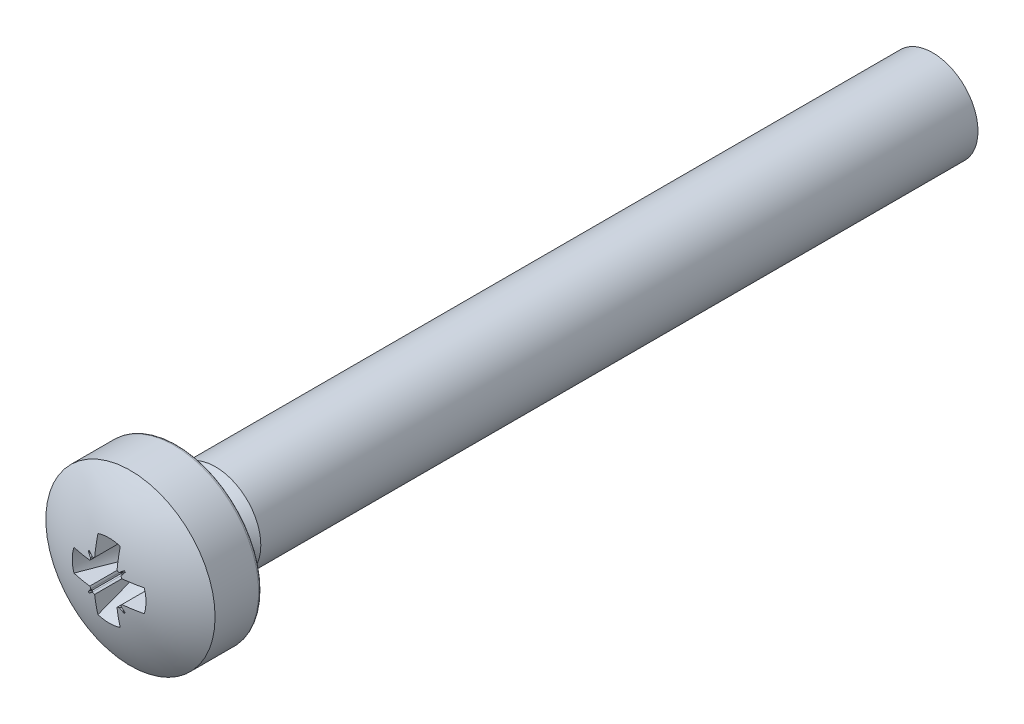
ISO-10303-21;
HEADER;
FILE_DESCRIPTION(('STEP AP214'),'2;1');
FILE_NAME('part.step','',(''),(''),'','','');
FILE_SCHEMA(('AUTOMOTIVE_DESIGN { 1 0 10303 214 1 1 1 1 }'));
ENDSEC;
DATA;
#1=APPLICATION_CONTEXT('core data for automotive mechanical design processes');
#2=APPLICATION_PROTOCOL_DEFINITION('international standard','automotive_design',2000,#1);
#3=PRODUCT_CONTEXT('',#1,'mechanical');
#4=PRODUCT('Part','Part','',(#3));
#5=PRODUCT_RELATED_PRODUCT_CATEGORY('part','',(#4));
#6=PRODUCT_DEFINITION_FORMATION('','',#4);
#7=PRODUCT_DEFINITION_CONTEXT('part definition',#1,'design');
#8=PRODUCT_DEFINITION('design','',#6,#7);
#9=PRODUCT_DEFINITION_SHAPE('','',#8);
#10=(LENGTH_UNIT() NAMED_UNIT(*) SI_UNIT(.MILLI.,.METRE.));
#11=(NAMED_UNIT(*) PLANE_ANGLE_UNIT() SI_UNIT($,.RADIAN.));
#12=(NAMED_UNIT(*) SI_UNIT($,.STERADIAN.) SOLID_ANGLE_UNIT());
#13=UNCERTAINTY_MEASURE_WITH_UNIT(LENGTH_MEASURE(1.E-05),#10,'distance_accuracy_value','');
#14=(GEOMETRIC_REPRESENTATION_CONTEXT(3) GLOBAL_UNCERTAINTY_ASSIGNED_CONTEXT((#13)) GLOBAL_UNIT_ASSIGNED_CONTEXT((#10,
#11,#12)) REPRESENTATION_CONTEXT('',''));
#15=CARTESIAN_POINT('',(0.,0.,0.));
#16=DIRECTION('',(0.,0.,1.));
#17=DIRECTION('',(1.,0.,0.));
#18=AXIS2_PLACEMENT_3D('',#15,#16,#17);
#19=CARTESIAN_POINT('',(0.,0.,-2.6));
#20=DIRECTION('',(1.,0.,0.));
#21=DIRECTION('',(0.,0.,-1.));
#22=AXIS2_PLACEMENT_3D('',#19,#20,#21);
#23=SPHERICAL_SURFACE('',#22,5.);
#24=CARTESIAN_POINT('',(0.37,0.,-2.6));
#25=DIRECTION('',(1.,0.,0.));
#26=DIRECTION('',(0.,0.,-1.));
#27=AXIS2_PLACEMENT_3D('',#24,#25,#26);
#28=CIRCLE('',#27,4.98629120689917);
#29=CARTESIAN_POINT('',(0.37,-0.529627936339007,2.35808372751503));
#30=VERTEX_POINT('',#29);
#31=CARTESIAN_POINT('',(0.37,-1.16318247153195,2.24872215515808));
#32=VERTEX_POINT('',#31);
#33=EDGE_CURVE('E25',#30,#32,#28,.T.);
#34=ORIENTED_EDGE('',*,*,#33,.T.);
#35=CARTESIAN_POINT('',(0.,0.,2.24872215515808));
#36=DIRECTION('',(0.,0.,-1.));
#37=DIRECTION('',(0.,1.,0.));
#38=AXIS2_PLACEMENT_3D('',#35,#36,#37);
#39=CIRCLE('',#38,1.22061192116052);
#40=CARTESIAN_POINT('',(-0.37,-1.16318247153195,2.24872215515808));
#41=VERTEX_POINT('',#40);
#42=EDGE_CURVE('E11',#32,#41,#39,.T.);
#43=ORIENTED_EDGE('',*,*,#42,.T.);
#44=CARTESIAN_POINT('',(-0.37,0.,-2.6));
#45=DIRECTION('',(1.,0.,0.));
#46=DIRECTION('',(0.,-1.,0.));
#47=AXIS2_PLACEMENT_3D('',#44,#45,#46);
#48=CIRCLE('',#47,4.98629120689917);
#49=CARTESIAN_POINT('',(-0.37,-0.529627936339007,2.35808372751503));
#50=VERTEX_POINT('',#49);
#51=EDGE_CURVE('E1353',#50,#41,#48,.T.);
#52=ORIENTED_EDGE('',*,*,#51,.F.);
#53=CARTESIAN_POINT('',(-0.444476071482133,-0.502939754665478,2.35474445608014));
#54=CARTESIAN_POINT('',(-0.437160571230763,-0.503188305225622,2.35537565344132));
#55=CARTESIAN_POINT('',(-0.429859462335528,-0.504068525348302,2.35592475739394));
#56=CARTESIAN_POINT('',(-0.415681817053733,-0.507004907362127,2.3568342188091));
#57=CARTESIAN_POINT('',(-0.408799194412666,-0.509030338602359,2.35719905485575));
#58=CARTESIAN_POINT('',(-0.396448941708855,-0.513805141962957,2.35770811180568));
#59=CARTESIAN_POINT('',(-0.390922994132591,-0.516402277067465,2.35787705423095));
#60=CARTESIAN_POINT('',(-0.380166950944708,-0.522410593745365,2.35808422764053));
#61=CARTESIAN_POINT('',(-0.374946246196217,-0.525838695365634,2.35811944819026));
#62=CARTESIAN_POINT('',(-0.3699998,-0.529628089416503,2.35808372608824));
#63=B_SPLINE_CURVE_WITH_KNOTS('',3,(#53,#54,#55,#56,#57,#58,#59,#60,#61,#62),.UNSPECIFIED.,.F.,
.F.,(4,2,2,2,4),(0.,0.0220151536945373,0.0434658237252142,0.0617299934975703,
0.0804029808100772),.UNSPECIFIED.);
#64=CARTESIAN_POINT('',(-0.441218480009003,-0.503094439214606,2.35501990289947));
#65=VERTEX_POINT('',#64);
#66=EDGE_CURVE('E1275',#65,#50,#63,.T.);
#67=ORIENTED_EDGE('',*,*,#66,.F.);
#68=CARTESIAN_POINT('',(-1.67269810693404,1.67269810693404,-0.784847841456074));
#69=DIRECTION('',(-0.560985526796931,0.560985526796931,0.608761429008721));
#70=DIRECTION('',(0.,-0.735373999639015,0.677661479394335));
#71=AXIS2_PLACEMENT_3D('',#68,#69,#70);
#72=CIRCLE('',#71,4.01364980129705);
#73=CARTESIAN_POINT('',(-0.581462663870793,-0.613988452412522,2.32797314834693));
#74=VERTEX_POINT('',#73);
#75=EDGE_CURVE('E1273',#74,#65,#72,.T.);
#76=ORIENTED_EDGE('',*,*,#75,.F.);
#77=CARTESIAN_POINT('',(0.4748329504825,0.4748329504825,2.11179830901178));
#78=DIRECTION('',(0.0997672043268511,0.0997672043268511,0.989996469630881));
#79=DIRECTION('',(0.994960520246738,0.,-0.10026745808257));
#80=AXIS2_PLACEMENT_3D('',#77,#78,#79);
#81=CIRCLE('',#80,1.53232634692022);
#82=CARTESIAN_POINT('',(-0.613988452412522,-0.581462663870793,2.32797314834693));
#83=VERTEX_POINT('',#82);
#84=EDGE_CURVE('E1252',#83,#74,#81,.T.);
#85=ORIENTED_EDGE('',*,*,#84,.F.);
#86=CARTESIAN_POINT('',(1.67269810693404,-1.67269810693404,-0.784847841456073));
#87=DIRECTION('',(-0.560985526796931,0.560985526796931,-0.608761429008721));
#88=DIRECTION('',(-0.735373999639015,0.,0.677661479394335));
#89=AXIS2_PLACEMENT_3D('',#86,#87,#88);
#90=CIRCLE('',#89,4.01364980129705);
#91=CARTESIAN_POINT('',(-0.503094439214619,-0.441218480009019,2.35501990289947));
#92=VERTEX_POINT('',#91);
#93=EDGE_CURVE('E1182',#83,#92,#90,.T.);
#94=ORIENTED_EDGE('',*,*,#93,.T.);
#95=CARTESIAN_POINT('',(-0.502939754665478,-0.444476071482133,2.35474445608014));
#96=CARTESIAN_POINT('',(-0.503188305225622,-0.437160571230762,2.35537565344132));
#97=CARTESIAN_POINT('',(-0.504068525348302,-0.429859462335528,2.35592475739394));
#98=CARTESIAN_POINT('',(-0.507004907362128,-0.415681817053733,2.3568342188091));
#99=CARTESIAN_POINT('',(-0.50903033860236,-0.408799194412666,2.35719905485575));
#100=CARTESIAN_POINT('',(-0.513805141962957,-0.396448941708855,2.35770811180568));
#101=CARTESIAN_POINT('',(-0.516402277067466,-0.390922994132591,2.35787705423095));
#102=CARTESIAN_POINT('',(-0.522410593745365,-0.380166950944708,2.35808422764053));
#103=CARTESIAN_POINT('',(-0.525838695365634,-0.374946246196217,2.35811944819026));
#104=CARTESIAN_POINT('',(-0.529628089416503,-0.3699998,2.35808372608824));
#105=B_SPLINE_CURVE_WITH_KNOTS('',3,(#95,#96,#97,#98,#99,#100,#101,#102,#103,#104),
.UNSPECIFIED.,.F.,.F.,(4,2,2,2,4),(0.,0.0220151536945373,0.0434658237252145,0.0617299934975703,
0.080402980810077),.UNSPECIFIED.);
#106=CARTESIAN_POINT('',(-0.529627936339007,-0.37,2.35808372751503));
#107=VERTEX_POINT('',#106);
#108=EDGE_CURVE('E1167',#92,#107,#105,.T.);
#109=ORIENTED_EDGE('',*,*,#108,.T.);
#110=CARTESIAN_POINT('',(0.,-0.37,-2.6));
#111=DIRECTION('',(0.,1.,0.));
#112=DIRECTION('',(0.,0.,1.));
#113=AXIS2_PLACEMENT_3D('',#110,#111,#112);
#114=CIRCLE('',#113,4.98629120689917);
#115=CARTESIAN_POINT('',(-1.16318247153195,-0.37,2.24872215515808));
#116=VERTEX_POINT('',#115);
#117=EDGE_CURVE('E1175',#116,#107,#114,.T.);
#118=ORIENTED_EDGE('',*,*,#117,.F.);
#119=CARTESIAN_POINT('',(0.,0.,2.24872215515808));
#120=DIRECTION('',(0.,0.,-1.));
#121=DIRECTION('',(0.,1.,0.));
#122=AXIS2_PLACEMENT_3D('',#119,#120,#121);
#123=CIRCLE('',#122,1.22061192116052);
#124=CARTESIAN_POINT('',(-1.16318247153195,0.37,2.24872215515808));
#125=VERTEX_POINT('',#124);
#126=EDGE_CURVE('E1242',#116,#125,#123,.T.);
#127=ORIENTED_EDGE('',*,*,#126,.T.);
#128=CARTESIAN_POINT('',(0.,0.37,-2.6));
#129=DIRECTION('',(0.,1.,0.));
#130=DIRECTION('',(0.,0.,1.));
#131=AXIS2_PLACEMENT_3D('',#128,#129,#130);
#132=CIRCLE('',#131,4.98629120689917);
#133=CARTESIAN_POINT('',(-0.529627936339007,0.37,2.35808372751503));
#134=VERTEX_POINT('',#133);
#135=EDGE_CURVE('E974',#125,#134,#132,.T.);
#136=ORIENTED_EDGE('',*,*,#135,.T.);
#137=CARTESIAN_POINT('',(-0.502939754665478,0.444476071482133,2.35474445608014));
#138=CARTESIAN_POINT('',(-0.503188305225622,0.437160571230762,2.35537565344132));
#139=CARTESIAN_POINT('',(-0.504068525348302,0.429859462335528,2.35592475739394));
#140=CARTESIAN_POINT('',(-0.507004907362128,0.415681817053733,2.3568342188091));
#141=CARTESIAN_POINT('',(-0.50903033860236,0.408799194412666,2.35719905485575));
#142=CARTESIAN_POINT('',(-0.513805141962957,0.396448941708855,2.35770811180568));
#143=CARTESIAN_POINT('',(-0.516402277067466,0.390922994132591,2.35787705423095));
#144=CARTESIAN_POINT('',(-0.522410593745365,0.380166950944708,2.35808422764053));
#145=CARTESIAN_POINT('',(-0.525838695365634,0.374946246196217,2.35811944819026));
#146=CARTESIAN_POINT('',(-0.529628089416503,0.3699998,2.35808372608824));
#147=B_SPLINE_CURVE_WITH_KNOTS('',3,(#137,#138,#139,#140,#141,#142,#143,#144,#145,#146),
.UNSPECIFIED.,.F.,.F.,(4,2,2,2,4),(0.,0.0220151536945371,0.043465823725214,0.0617299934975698,
0.0804029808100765),.UNSPECIFIED.);
#148=CARTESIAN_POINT('',(-0.50309443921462,0.44121848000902,2.35501990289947));
#149=VERTEX_POINT('',#148);
#150=EDGE_CURVE('E40',#149,#134,#147,.T.);
#151=ORIENTED_EDGE('',*,*,#150,.F.);
#152=CARTESIAN_POINT('',(1.67269810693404,1.67269810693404,-0.784847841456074));
#153=DIRECTION('',(0.560985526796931,0.560985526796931,0.608761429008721));
#154=DIRECTION('',(0.735373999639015,0.,-0.677661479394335));
#155=AXIS2_PLACEMENT_3D('',#152,#153,#154);
#156=CIRCLE('',#155,4.01364980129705);
#157=CARTESIAN_POINT('',(-0.613988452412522,0.581462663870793,2.32797314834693));
#158=VERTEX_POINT('',#157);
#159=EDGE_CURVE('E360',#158,#149,#156,.T.);
#160=ORIENTED_EDGE('',*,*,#159,.F.);
#161=CARTESIAN_POINT('',(0.4748329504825,-0.4748329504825,2.11179830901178));
#162=DIRECTION('',(0.099767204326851,-0.099767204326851,0.989996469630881));
#163=DIRECTION('',(0.994960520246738,0.,-0.10026745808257));
#164=AXIS2_PLACEMENT_3D('',#161,#162,#163);
#165=CIRCLE('',#164,1.53232634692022);
#166=CARTESIAN_POINT('',(-0.581462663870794,0.613988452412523,2.32797314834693));
#167=VERTEX_POINT('',#166);
#168=EDGE_CURVE('E308',#167,#158,#165,.T.);
#169=ORIENTED_EDGE('',*,*,#168,.F.);
#170=CARTESIAN_POINT('',(-1.67269810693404,-1.67269810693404,-0.784847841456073));
#171=DIRECTION('',(0.560985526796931,0.560985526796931,-0.608761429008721));
#172=DIRECTION('',(-0.735373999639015,0.,-0.677661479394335));
#173=AXIS2_PLACEMENT_3D('',#170,#171,#172);
#174=CIRCLE('',#173,4.01364980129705);
#175=CARTESIAN_POINT('',(-0.441218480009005,0.503094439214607,2.35501990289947));
#176=VERTEX_POINT('',#175);
#177=EDGE_CURVE('E363',#167,#176,#174,.T.);
#178=ORIENTED_EDGE('',*,*,#177,.T.);
#179=CARTESIAN_POINT('',(-0.444476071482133,0.502939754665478,2.35474445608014));
#180=CARTESIAN_POINT('',(-0.437160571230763,0.503188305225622,2.35537565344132));
#181=CARTESIAN_POINT('',(-0.429859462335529,0.504068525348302,2.35592475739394));
#182=CARTESIAN_POINT('',(-0.415681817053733,0.507004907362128,2.3568342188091));
#183=CARTESIAN_POINT('',(-0.408799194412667,0.50903033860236,2.35719905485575));
#184=CARTESIAN_POINT('',(-0.396448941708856,0.513805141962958,2.35770811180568));
#185=CARTESIAN_POINT('',(-0.390922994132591,0.516402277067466,2.35787705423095));
#186=CARTESIAN_POINT('',(-0.380166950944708,0.522410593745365,2.35808422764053));
#187=CARTESIAN_POINT('',(-0.374946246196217,0.525838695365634,2.35811944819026));
#188=CARTESIAN_POINT('',(-0.3699998,0.529628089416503,2.35808372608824));
#189=B_SPLINE_CURVE_WITH_KNOTS('',3,(#179,#180,#181,#182,#183,#184,#185,#186,#187,#188),
.UNSPECIFIED.,.F.,.F.,(4,2,2,2,4),(0.,0.0220151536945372,0.043465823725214,0.0617299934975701,
0.0804029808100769),.UNSPECIFIED.);
#190=CARTESIAN_POINT('',(-0.37,0.529627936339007,2.35808372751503));
#191=VERTEX_POINT('',#190);
#192=EDGE_CURVE('E366',#176,#191,#189,.T.);
#193=ORIENTED_EDGE('',*,*,#192,.T.);
#194=CARTESIAN_POINT('',(-0.37,0.,-2.6));
#195=DIRECTION('',(1.,0.,0.));
#196=DIRECTION('',(0.,0.,-1.));
#197=AXIS2_PLACEMENT_3D('',#194,#195,#196);
#198=CIRCLE('',#197,4.98629120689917);
#199=CARTESIAN_POINT('',(-0.37,1.16318247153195,2.24872215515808));
#200=VERTEX_POINT('',#199);
#201=EDGE_CURVE('E373',#200,#191,#198,.T.);
#202=ORIENTED_EDGE('',*,*,#201,.F.);
#203=CARTESIAN_POINT('',(0.,0.,2.24872215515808));
#204=DIRECTION('',(0.,0.,-1.));
#205=DIRECTION('',(0.,1.,0.));
#206=AXIS2_PLACEMENT_3D('',#203,#204,#205);
#207=CIRCLE('',#206,1.22061192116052);
#208=CARTESIAN_POINT('',(0.37,1.16318247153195,2.24872215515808));
#209=VERTEX_POINT('',#208);
#210=EDGE_CURVE('E1314',#200,#209,#207,.T.);
#211=ORIENTED_EDGE('',*,*,#210,.T.);
#212=CARTESIAN_POINT('',(0.37,0.,-2.6));
#213=DIRECTION('',(1.,0.,0.));
#214=DIRECTION('',(0.,0.,-1.));
#215=AXIS2_PLACEMENT_3D('',#212,#213,#214);
#216=CIRCLE('',#215,4.98629120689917);
#217=CARTESIAN_POINT('',(0.37,0.529627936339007,2.35808372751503));
#218=VERTEX_POINT('',#217);
#219=EDGE_CURVE('E1232',#209,#218,#216,.T.);
#220=ORIENTED_EDGE('',*,*,#219,.T.);
#221=CARTESIAN_POINT('',(0.444476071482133,0.502939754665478,2.35474445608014));
#222=CARTESIAN_POINT('',(0.437160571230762,0.503188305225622,2.35537565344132));
#223=CARTESIAN_POINT('',(0.429859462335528,0.504068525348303,2.35592475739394));
#224=CARTESIAN_POINT('',(0.415681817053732,0.507004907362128,2.3568342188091));
#225=CARTESIAN_POINT('',(0.408799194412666,0.50903033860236,2.35719905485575));
#226=CARTESIAN_POINT('',(0.396448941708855,0.513805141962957,2.35770811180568));
#227=CARTESIAN_POINT('',(0.390922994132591,0.516402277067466,2.35787705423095));
#228=CARTESIAN_POINT('',(0.380166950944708,0.522410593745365,2.35808422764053));
#229=CARTESIAN_POINT('',(0.374946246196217,0.525838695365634,2.35811944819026));
#230=CARTESIAN_POINT('',(0.3699998,0.529628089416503,2.35808372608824));
#231=B_SPLINE_CURVE_WITH_KNOTS('',3,(#221,#222,#223,#224,#225,#226,#227,#228,#229,#230),
.UNSPECIFIED.,.F.,.F.,(4,2,2,2,4),(0.,0.0220151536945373,0.0434658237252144,0.0617299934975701,
0.0804029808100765),.UNSPECIFIED.);
#232=CARTESIAN_POINT('',(0.441218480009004,0.503094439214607,2.35501990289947));
#233=VERTEX_POINT('',#232);
#234=EDGE_CURVE('E1226',#233,#218,#231,.T.);
#235=ORIENTED_EDGE('',*,*,#234,.F.);
#236=CARTESIAN_POINT('',(1.67269810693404,-1.67269810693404,-0.784847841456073));
#237=DIRECTION('',(0.560985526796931,-0.560985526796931,0.608761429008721));
#238=DIRECTION('',(0.,-0.735373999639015,-0.677661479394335));
#239=AXIS2_PLACEMENT_3D('',#236,#237,#238);
#240=CIRCLE('',#239,4.01364980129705);
#241=CARTESIAN_POINT('',(0.581462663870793,0.613988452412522,2.32797314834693));
#242=VERTEX_POINT('',#241);
#243=EDGE_CURVE('E1238',#242,#233,#240,.T.);
#244=ORIENTED_EDGE('',*,*,#243,.F.);
#245=CARTESIAN_POINT('',(-0.4748329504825,-0.474832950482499,2.11179830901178));
#246=DIRECTION('',(-0.0997672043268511,-0.0997672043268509,0.989996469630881));
#247=DIRECTION('',(0.994960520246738,0.,0.10026745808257));
#248=AXIS2_PLACEMENT_3D('',#245,#246,#247);
#249=CIRCLE('',#248,1.53232634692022);
#250=CARTESIAN_POINT('',(0.613988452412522,0.581462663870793,2.32797314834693));
#251=VERTEX_POINT('',#250);
#252=EDGE_CURVE('E1240',#251,#242,#249,.T.);
#253=ORIENTED_EDGE('',*,*,#252,.F.);
#254=CARTESIAN_POINT('',(-1.67269810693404,1.67269810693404,-0.784847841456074));
#255=DIRECTION('',(0.560985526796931,-0.560985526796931,-0.608761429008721));
#256=DIRECTION('',(0.,0.735373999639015,-0.677661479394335));
#257=AXIS2_PLACEMENT_3D('',#254,#255,#256);
#258=CIRCLE('',#257,4.01364980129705);
#259=CARTESIAN_POINT('',(0.503094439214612,0.44121848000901,2.35501990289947));
#260=VERTEX_POINT('',#259);
#261=EDGE_CURVE('E1243',#251,#260,#258,.T.);
#262=ORIENTED_EDGE('',*,*,#261,.T.);
#263=CARTESIAN_POINT('',(0.502939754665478,0.444476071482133,2.35474445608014));
#264=CARTESIAN_POINT('',(0.503188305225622,0.437160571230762,2.35537565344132));
#265=CARTESIAN_POINT('',(0.504068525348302,0.429859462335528,2.35592475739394));
#266=CARTESIAN_POINT('',(0.507004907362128,0.415681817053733,2.3568342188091));
#267=CARTESIAN_POINT('',(0.50903033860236,0.408799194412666,2.35719905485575));
#268=CARTESIAN_POINT('',(0.513805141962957,0.396448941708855,2.35770811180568));
#269=CARTESIAN_POINT('',(0.516402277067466,0.390922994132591,2.35787705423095));
#270=CARTESIAN_POINT('',(0.522410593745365,0.380166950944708,2.35808422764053));
#271=CARTESIAN_POINT('',(0.525838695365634,0.374946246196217,2.35811944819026));
#272=CARTESIAN_POINT('',(0.529628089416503,0.3699998,2.35808372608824));
#273=B_SPLINE_CURVE_WITH_KNOTS('',3,(#263,#264,#265,#266,#267,#268,#269,#270,#271,#272),
.UNSPECIFIED.,.F.,.F.,(4,2,2,2,4),(0.,0.0220151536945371,0.043465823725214,0.0617299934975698,
0.0804029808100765),.UNSPECIFIED.);
#274=CARTESIAN_POINT('',(0.529627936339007,0.37,2.35808372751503));
#275=VERTEX_POINT('',#274);
#276=EDGE_CURVE('E1174',#260,#275,#273,.T.);
#277=ORIENTED_EDGE('',*,*,#276,.T.);
#278=CARTESIAN_POINT('',(0.,0.37,-2.6));
#279=DIRECTION('',(0.,1.,0.));
#280=DIRECTION('',(0.,0.,1.));
#281=AXIS2_PLACEMENT_3D('',#278,#279,#280);
#282=CIRCLE('',#281,4.98629120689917);
#283=CARTESIAN_POINT('',(1.16318247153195,0.37,2.24872215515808));
#284=VERTEX_POINT('',#283);
#285=EDGE_CURVE('E1254',#275,#284,#282,.T.);
#286=ORIENTED_EDGE('',*,*,#285,.T.);
#287=CARTESIAN_POINT('',(0.,0.,2.24872215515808));
#288=DIRECTION('',(0.,0.,-1.));
#289=DIRECTION('',(0.,1.,0.));
#290=AXIS2_PLACEMENT_3D('',#287,#288,#289);
#291=CIRCLE('',#290,1.22061192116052);
#292=CARTESIAN_POINT('',(1.16318247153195,-0.37,2.24872215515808));
#293=VERTEX_POINT('',#292);
#294=EDGE_CURVE('E1256',#284,#293,#291,.T.);
#295=ORIENTED_EDGE('',*,*,#294,.T.);
#296=CARTESIAN_POINT('',(0.,-0.37,-2.6));
#297=DIRECTION('',(0.,1.,0.));
#298=DIRECTION('',(0.,0.,1.));
#299=AXIS2_PLACEMENT_3D('',#296,#297,#298);
#300=CIRCLE('',#299,4.98629120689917);
#301=CARTESIAN_POINT('',(0.529627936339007,-0.37,2.35808372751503));
#302=VERTEX_POINT('',#301);
#303=EDGE_CURVE('E1258',#302,#293,#300,.T.);
#304=ORIENTED_EDGE('',*,*,#303,.F.);
#305=CARTESIAN_POINT('',(0.502939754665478,-0.444476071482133,2.35474445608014));
#306=CARTESIAN_POINT('',(0.503188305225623,-0.437160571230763,2.35537565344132));
#307=CARTESIAN_POINT('',(0.504068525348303,-0.429859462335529,2.35592475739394));
#308=CARTESIAN_POINT('',(0.507004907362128,-0.415681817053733,2.3568342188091));
#309=CARTESIAN_POINT('',(0.509030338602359,-0.408799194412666,2.35719905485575));
#310=CARTESIAN_POINT('',(0.513805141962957,-0.396448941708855,2.35770811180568));
#311=CARTESIAN_POINT('',(0.516402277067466,-0.390922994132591,2.35787705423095));
#312=CARTESIAN_POINT('',(0.522410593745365,-0.380166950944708,2.35808422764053));
#313=CARTESIAN_POINT('',(0.525838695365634,-0.374946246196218,2.35811944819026));
#314=CARTESIAN_POINT('',(0.529628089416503,-0.3699998,2.35808372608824));
#315=B_SPLINE_CURVE_WITH_KNOTS('',3,(#305,#306,#307,#308,#309,#310,#311,#312,#313,#314),
.UNSPECIFIED.,.F.,.F.,(4,2,2,2,4),(0.,0.0220151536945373,0.0434658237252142,0.0617299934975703,
0.0804029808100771),.UNSPECIFIED.);
#316=CARTESIAN_POINT('',(0.503094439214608,-0.441218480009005,2.35501990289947));
#317=VERTEX_POINT('',#316);
#318=EDGE_CURVE('E1262',#317,#302,#315,.T.);
#319=ORIENTED_EDGE('',*,*,#318,.F.);
#320=CARTESIAN_POINT('',(-1.67269810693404,-1.67269810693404,-0.784847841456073));
#321=DIRECTION('',(-0.560985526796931,-0.560985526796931,0.608761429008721));
#322=DIRECTION('',(0.735373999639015,0.,0.677661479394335));
#323=AXIS2_PLACEMENT_3D('',#320,#321,#322);
#324=CIRCLE('',#323,4.01364980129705);
#325=CARTESIAN_POINT('',(0.613988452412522,-0.581462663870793,2.32797314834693));
#326=VERTEX_POINT('',#325);
#327=EDGE_CURVE('E1267',#326,#317,#324,.T.);
#328=ORIENTED_EDGE('',*,*,#327,.F.);
#329=CARTESIAN_POINT('',(-0.474832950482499,0.474832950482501,2.11179830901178));
#330=DIRECTION('',(-0.099767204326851,0.0997672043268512,0.989996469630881));
#331=DIRECTION('',(0.,-0.994960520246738,0.10026745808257));
#332=AXIS2_PLACEMENT_3D('',#329,#330,#331);
#333=CIRCLE('',#332,1.53232634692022);
#334=CARTESIAN_POINT('',(0.581462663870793,-0.613988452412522,2.32797314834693));
#335=VERTEX_POINT('',#334);
#336=EDGE_CURVE('E1280',#335,#326,#333,.T.);
#337=ORIENTED_EDGE('',*,*,#336,.F.);
#338=CARTESIAN_POINT('',(1.67269810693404,1.67269810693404,-0.784847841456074));
#339=DIRECTION('',(-0.560985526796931,-0.560985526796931,-0.608761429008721));
#340=DIRECTION('',(0.,0.735373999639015,-0.677661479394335));
#341=AXIS2_PLACEMENT_3D('',#338,#339,#340);
#342=CIRCLE('',#341,4.01364980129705);
#343=CARTESIAN_POINT('',(0.441218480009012,-0.503094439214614,2.35501990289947));
#344=VERTEX_POINT('',#343);
#345=EDGE_CURVE('E1356',#335,#344,#342,.T.);
#346=ORIENTED_EDGE('',*,*,#345,.T.);
#347=CARTESIAN_POINT('',(0.444476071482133,-0.502939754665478,2.35474445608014));
#348=CARTESIAN_POINT('',(0.437160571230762,-0.503188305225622,2.35537565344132));
#349=CARTESIAN_POINT('',(0.429859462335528,-0.504068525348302,2.35592475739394));
#350=CARTESIAN_POINT('',(0.415681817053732,-0.507004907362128,2.3568342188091));
#351=CARTESIAN_POINT('',(0.408799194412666,-0.50903033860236,2.35719905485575));
#352=CARTESIAN_POINT('',(0.396448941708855,-0.513805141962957,2.35770811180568));
#353=CARTESIAN_POINT('',(0.390922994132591,-0.516402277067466,2.35787705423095));
#354=CARTESIAN_POINT('',(0.380166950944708,-0.522410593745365,2.35808422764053));
#355=CARTESIAN_POINT('',(0.374946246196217,-0.525838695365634,2.35811944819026));
#356=CARTESIAN_POINT('',(0.3699998,-0.529628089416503,2.35808372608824));
#357=B_SPLINE_CURVE_WITH_KNOTS('',3,(#347,#348,#349,#350,#351,#352,#353,#354,#355,#356),
.UNSPECIFIED.,.F.,.F.,(4,2,2,2,4),(0.,0.0220151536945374,0.0434658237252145,0.0617299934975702,
0.0804029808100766),.UNSPECIFIED.);
#358=EDGE_CURVE('E1354',#344,#30,#357,.T.);
#359=ORIENTED_EDGE('',*,*,#358,.T.);
#360=EDGE_LOOP('',(#34,#43,#52,#67,#76,#85,#94,#109,#118,#127,#136,#151,#160,#169,#178,#193,
#202,#211,#220,#235,#244,#253,#262,#277,#286,#295,#304,#319,#328,#337,#346,#359));
#361=FACE_BOUND('',#360,.T.);
#362=CARTESIAN_POINT('',(0.,0.,1.54246303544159));
#363=DIRECTION('',(0.,0.,1.));
#364=DIRECTION('',(1.,0.,0.));
#365=AXIS2_PLACEMENT_3D('',#362,#363,#364);
#366=CIRCLE('',#365,2.8);
#367=CARTESIAN_POINT('',(2.8,0.,1.5424630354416));
#368=VERTEX_POINT('',#367);
#369=EDGE_CURVE('E327',#368,#368,#366,.T.);
#370=ORIENTED_EDGE('',*,*,#369,.T.);
#371=EDGE_LOOP('',(#370));
#372=FACE_BOUND('',#371,.T.);
#373=ADVANCED_FACE('F17',(#361,#372),#23,.T.);
#374=CARTESIAN_POINT('',(0.,0.,-25.));
#375=DIRECTION('',(0.,0.,1.));
#376=DIRECTION('',(1.,0.,0.));
#377=AXIS2_PLACEMENT_3D('',#374,#375,#376);
#378=PLANE('',#377);
#379=CARTESIAN_POINT('',(0.,0.,-25.));
#380=DIRECTION('',(0.,0.,1.));
#381=DIRECTION('',(1.,0.,0.));
#382=AXIS2_PLACEMENT_3D('',#379,#380,#381);
#383=CIRCLE('',#382,1.5);
#384=CARTESIAN_POINT('',(1.5,0.,-25.));
#385=VERTEX_POINT('',#384);
#386=EDGE_CURVE('E357',#385,#385,#383,.T.);
#387=ORIENTED_EDGE('',*,*,#386,.F.);
#388=EDGE_LOOP('',(#387));
#389=FACE_BOUND('',#388,.T.);
#390=ADVANCED_FACE('F569',(#389),#378,.F.);
#391=CARTESIAN_POINT('',(0.,0.,0.));
#392=DIRECTION('',(0.,0.,1.));
#393=DIRECTION('',(1.,0.,0.));
#394=AXIS2_PLACEMENT_3D('',#391,#392,#393);
#395=CYLINDRICAL_SURFACE('',#394,1.5);
#396=CARTESIAN_POINT('',(0.,0.,-1.270625));
#397=DIRECTION('',(0.,0.,1.));
#398=DIRECTION('',(1.,0.,0.));
#399=AXIS2_PLACEMENT_3D('',#396,#397,#398);
#400=CIRCLE('',#399,1.5);
#401=CARTESIAN_POINT('',(1.5,0.,-1.270625));
#402=VERTEX_POINT('',#401);
#403=EDGE_CURVE('E354',#402,#402,#400,.T.);
#404=ORIENTED_EDGE('',*,*,#403,.F.);
#405=EDGE_LOOP('',(#404));
#406=FACE_BOUND('',#405,.T.);
#407=ORIENTED_EDGE('',*,*,#386,.T.);
#408=EDGE_LOOP('',(#407));
#409=FACE_BOUND('',#408,.T.);
#410=ADVANCED_FACE('F574',(#406,#409),#395,.T.);
#411=CARTESIAN_POINT('',(0.,0.,-1.270625));
#412=DIRECTION('',(0.,0.,-1.));
#413=DIRECTION('',(-1.,0.,0.));
#414=AXIS2_PLACEMENT_3D('',#411,#412,#413);
#415=CONICAL_SURFACE('',#414,1.5,0.785398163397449);
#416=CARTESIAN_POINT('',(0.,0.,-1.));
#417=DIRECTION('',(0.,0.,1.));
#418=DIRECTION('',(1.,0.,0.));
#419=AXIS2_PLACEMENT_3D('',#416,#417,#418);
#420=CIRCLE('',#419,1.229375);
#421=CARTESIAN_POINT('',(1.229375,0.,-1.));
#422=VERTEX_POINT('',#421);
#423=EDGE_CURVE('E351',#422,#422,#420,.T.);
#424=ORIENTED_EDGE('',*,*,#423,.F.);
#425=EDGE_LOOP('',(#424));
#426=FACE_BOUND('',#425,.T.);
#427=ORIENTED_EDGE('',*,*,#403,.T.);
#428=EDGE_LOOP('',(#427));
#429=FACE_BOUND('',#428,.T.);
#430=ADVANCED_FACE('F615',(#426,#429),#415,.T.);
#431=CARTESIAN_POINT('',(0.,0.,0.));
#432=DIRECTION('',(0.,0.,1.));
#433=DIRECTION('',(1.,0.,0.));
#434=AXIS2_PLACEMENT_3D('',#431,#432,#433);
#435=CYLINDRICAL_SURFACE('',#434,1.229375);
#436=CARTESIAN_POINT('',(0.,0.,-0.75));
#437=DIRECTION('',(0.,0.,1.));
#438=DIRECTION('',(1.,0.,0.));
#439=AXIS2_PLACEMENT_3D('',#436,#437,#438);
#440=CIRCLE('',#439,1.229375);
#441=CARTESIAN_POINT('',(1.229375,0.,-0.75));
#442=VERTEX_POINT('',#441);
#443=EDGE_CURVE('E348',#442,#442,#440,.T.);
#444=ORIENTED_EDGE('',*,*,#443,.F.);
#445=EDGE_LOOP('',(#444));
#446=FACE_BOUND('',#445,.T.);
#447=ORIENTED_EDGE('',*,*,#423,.T.);
#448=EDGE_LOOP('',(#447));
#449=FACE_BOUND('',#448,.T.);
#450=ADVANCED_FACE('F611',(#446,#449),#435,.T.);
#451=CARTESIAN_POINT('',(0.,0.,-0.75));
#452=DIRECTION('',(0.,0.,1.));
#453=DIRECTION('',(1.,0.,0.));
#454=AXIS2_PLACEMENT_3D('',#451,#452,#453);
#455=TOROIDAL_SURFACE('',#454,1.329375,0.1);
#456=ORIENTED_EDGE('',*,*,#443,.T.);
#457=EDGE_LOOP('',(#456));
#458=FACE_BOUND('',#457,.T.);
#459=CARTESIAN_POINT('',(0.,0.,-0.680942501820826));
#460=DIRECTION('',(0.,0.,1.));
#461=DIRECTION('',(1.,0.,0.));
#462=AXIS2_PLACEMENT_3D('',#459,#460,#461);
#463=CIRCLE('',#462,1.25704891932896);
#464=CARTESIAN_POINT('',(1.25704891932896,0.,-0.680942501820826));
#465=VERTEX_POINT('',#464);
#466=EDGE_CURVE('E345',#465,#465,#463,.T.);
#467=ORIENTED_EDGE('',*,*,#466,.F.);
#468=EDGE_LOOP('',(#467));
#469=FACE_BOUND('',#468,.T.);
#470=ADVANCED_FACE('F605',(#458,#469),#455,.F.);
#471=CARTESIAN_POINT('',(0.,0.,-0.680942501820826));
#472=DIRECTION('',(0.,0.,1.));
#473=DIRECTION('',(1.,0.,0.));
#474=AXIS2_PLACEMENT_3D('',#471,#472,#473);
#475=CONICAL_SURFACE('',#474,1.25704891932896,0.762283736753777);
#476=CARTESIAN_POINT('',(0.,0.,-0.0309425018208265));
#477=DIRECTION('',(0.,0.,1.));
#478=DIRECTION('',(1.,0.,0.));
#479=AXIS2_PLACEMENT_3D('',#476,#477,#478);
#480=CIRCLE('',#479,1.87767391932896);
#481=CARTESIAN_POINT('',(1.87767391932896,0.,-0.0309425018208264));
#482=VERTEX_POINT('',#481);
#483=EDGE_CURVE('E342',#482,#482,#480,.T.);
#484=ORIENTED_EDGE('',*,*,#483,.F.);
#485=EDGE_LOOP('',(#484));
#486=FACE_BOUND('',#485,.T.);
#487=ORIENTED_EDGE('',*,*,#466,.T.);
#488=EDGE_LOOP('',(#487));
#489=FACE_BOUND('',#488,.T.);
#490=ADVANCED_FACE('F599',(#486,#489),#475,.T.);
#491=CARTESIAN_POINT('',(0.,0.,-0.1));
#492=DIRECTION('',(0.,0.,1.));
#493=DIRECTION('',(1.,0.,0.));
#494=AXIS2_PLACEMENT_3D('',#491,#492,#493);
#495=TOROIDAL_SURFACE('',#494,1.95,0.1);
#496=ORIENTED_EDGE('',*,*,#483,.T.);
#497=EDGE_LOOP('',(#496));
#498=FACE_BOUND('',#497,.T.);
#499=CARTESIAN_POINT('',(0.,0.,0.));
#500=DIRECTION('',(0.,0.,1.));
#501=DIRECTION('',(1.,0.,0.));
#502=AXIS2_PLACEMENT_3D('',#499,#500,#501);
#503=CIRCLE('',#502,1.95);
#504=CARTESIAN_POINT('',(1.95,0.,0.));
#505=VERTEX_POINT('',#504);
#506=EDGE_CURVE('E339',#505,#505,#503,.T.);
#507=ORIENTED_EDGE('',*,*,#506,.F.);
#508=EDGE_LOOP('',(#507));
#509=FACE_BOUND('',#508,.T.);
#510=ADVANCED_FACE('F594',(#498,#509),#495,.F.);
#511=CARTESIAN_POINT('',(0.,1.95,0.));
#512=DIRECTION('',(0.,0.,1.));
#513=DIRECTION('',(1.,0.,0.));
#514=AXIS2_PLACEMENT_3D('',#511,#512,#513);
#515=PLANE('',#514);
#516=CARTESIAN_POINT('',(0.,0.,0.));
#517=DIRECTION('',(0.,0.,1.));
#518=DIRECTION('',(1.,0.,0.));
#519=AXIS2_PLACEMENT_3D('',#516,#517,#518);
#520=CIRCLE('',#519,2.7);
#521=CARTESIAN_POINT('',(2.7,0.,0.));
#522=VERTEX_POINT('',#521);
#523=EDGE_CURVE('E336',#522,#522,#520,.T.);
#524=ORIENTED_EDGE('',*,*,#523,.F.);
#525=EDGE_LOOP('',(#524));
#526=FACE_BOUND('',#525,.T.);
#527=ORIENTED_EDGE('',*,*,#506,.T.);
#528=EDGE_LOOP('',(#527));
#529=FACE_BOUND('',#528,.T.);
#530=ADVANCED_FACE('F589',(#526,#529),#515,.F.);
#531=CARTESIAN_POINT('',(0.,0.,0.1));
#532=DIRECTION('',(0.,0.,1.));
#533=DIRECTION('',(1.,0.,0.));
#534=AXIS2_PLACEMENT_3D('',#531,#532,#533);
#535=TOROIDAL_SURFACE('',#534,2.7,0.1);
#536=CARTESIAN_POINT('',(0.,0.,0.1));
#537=DIRECTION('',(0.,0.,1.));
#538=DIRECTION('',(1.,0.,0.));
#539=AXIS2_PLACEMENT_3D('',#536,#537,#538);
#540=CIRCLE('',#539,2.8);
#541=CARTESIAN_POINT('',(2.8,0.,0.1));
#542=VERTEX_POINT('',#541);
#543=EDGE_CURVE('E333',#542,#542,#540,.T.);
#544=ORIENTED_EDGE('',*,*,#543,.F.);
#545=EDGE_LOOP('',(#544));
#546=FACE_BOUND('',#545,.T.);
#547=ORIENTED_EDGE('',*,*,#523,.T.);
#548=EDGE_LOOP('',(#547));
#549=FACE_BOUND('',#548,.T.);
#550=ADVANCED_FACE('F584',(#546,#549),#535,.T.);
#551=CARTESIAN_POINT('',(0.,0.,0.));
#552=DIRECTION('',(0.,0.,1.));
#553=DIRECTION('',(1.,0.,0.));
#554=AXIS2_PLACEMENT_3D('',#551,#552,#553);
#555=CYLINDRICAL_SURFACE('',#554,2.8);
#556=ORIENTED_EDGE('',*,*,#369,.F.);
#557=EDGE_LOOP('',(#556));
#558=FACE_BOUND('',#557,.T.);
#559=ORIENTED_EDGE('',*,*,#543,.T.);
#560=EDGE_LOOP('',(#559));
#561=FACE_BOUND('',#560,.T.);
#562=ADVANCED_FACE('F429',(#558,#561),#555,.T.);
#563=CARTESIAN_POINT('',(-0.37,0.37,0.347071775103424));
#564=DIRECTION('',(0.,1.,0.));
#565=DIRECTION('',(1.,0.,0.));
#566=AXIS2_PLACEMENT_3D('',#563,#564,#565);
#567=PLANE('',#566);
#568=CARTESIAN_POINT('',(-0.313793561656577,0.37,0.214331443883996));
#569=CARTESIAN_POINT('',(-0.329674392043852,0.37,0.242797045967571));
#570=CARTESIAN_POINT('',(-0.345062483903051,0.37,0.271528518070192));
#571=CARTESIAN_POINT('',(-0.375066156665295,0.37,0.329383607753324));
#572=CARTESIAN_POINT('',(-0.389681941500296,0.37,0.358507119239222));
#573=CARTESIAN_POINT('',(-0.418353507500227,0.37,0.417004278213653));
#574=CARTESIAN_POINT('',(-0.432409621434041,0.37,0.446377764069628));
#575=CARTESIAN_POINT('',(-0.460093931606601,0.37,0.505328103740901));
#576=CARTESIAN_POINT('',(-0.473722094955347,0.37,0.534904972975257));
#577=CARTESIAN_POINT('',(-0.5140815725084,0.37,0.623804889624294));
#578=CARTESIAN_POINT('',(-0.540314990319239,0.37,0.683353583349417));
#579=CARTESIAN_POINT('',(-0.591913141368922,0.37,0.802836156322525));
#580=CARTESIAN_POINT('',(-0.61727771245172,0.37,0.862770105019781));
#581=CARTESIAN_POINT('',(-0.677835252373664,0.37,1.00791399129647));
#582=CARTESIAN_POINT('',(-0.712720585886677,0.37,1.09325207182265));
#583=CARTESIAN_POINT('',(-0.781694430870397,0.37,1.26424145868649));
#584=CARTESIAN_POINT('',(-0.815782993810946,0.37,1.34989274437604));
#585=CARTESIAN_POINT('',(-0.917285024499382,0.37,1.607283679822));
#586=CARTESIAN_POINT('',(-0.983886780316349,0.37,1.77934291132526));
#587=CARTESIAN_POINT('',(-1.12569595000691,0.37,2.14933579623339));
#588=CARTESIAN_POINT('',(-1.20072190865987,0.37,2.34733853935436));
#589=CARTESIAN_POINT('',(-1.34990776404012,0.37,2.74366988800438));
#590=CARTESIAN_POINT('',(-1.4240676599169,0.37,2.94199849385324));
#591=CARTESIAN_POINT('',(-1.57171815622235,0.37,3.33850012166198));
#592=CARTESIAN_POINT('',(-1.64520971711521,0.37,3.53667278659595));
#593=CARTESIAN_POINT('',(-1.79182020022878,0.37,3.93315304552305));
#594=CARTESIAN_POINT('',(-1.86493912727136,0.37,4.13146063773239));
#595=CARTESIAN_POINT('',(-1.93795391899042,0.37,4.32980627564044));
#596=B_SPLINE_CURVE_WITH_KNOTS('',3,(#568,#569,#570,#571,#572,#573,#574,#575,#576,#577,#578,
#579,#580,#581,#582,#583,#584,#585,#586,#587,#588,#589,#590,#591,#592,#593,#594,#595),
.UNSPECIFIED.,.F.,.F.,(4,2,2,2,2,2,2,2,2,2,2,2,2,4),(0.,0.0977715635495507,0.195517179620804,
0.293203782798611,0.390897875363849,0.586098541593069,0.781335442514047,1.05790775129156,
1.3344621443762,1.88795172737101,2.52317042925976,3.15838975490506,3.79247197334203,
4.42654596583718),.UNSPECIFIED.);
#597=CARTESIAN_POINT('',(-0.546534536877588,0.37,0.698));
#598=VERTEX_POINT('',#597);
#599=EDGE_CURVE('E542',#125,#598,#596,.F.);
#600=ORIENTED_EDGE('',*,*,#599,.T.);
#601=CARTESIAN_POINT('',(-0.0594724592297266,0.37,0.546329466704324));
#602=CARTESIAN_POINT('',(-0.0864234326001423,0.37,0.548587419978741));
#603=CARTESIAN_POINT('',(-0.113179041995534,0.37,0.552376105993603));
#604=CARTESIAN_POINT('',(-0.166159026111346,0.37,0.562332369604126));
#605=CARTESIAN_POINT('',(-0.192384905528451,0.37,0.568491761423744));
#606=CARTESIAN_POINT('',(-0.244172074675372,0.37,0.582483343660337));
#607=CARTESIAN_POINT('',(-0.26973668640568,0.37,0.59030378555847));
#608=CARTESIAN_POINT('',(-0.320491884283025,0.37,0.607132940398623));
#609=CARTESIAN_POINT('',(-0.345682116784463,0.37,0.616142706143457));
#610=CARTESIAN_POINT('',(-0.404390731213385,0.37,0.638234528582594));
#611=CARTESIAN_POINT('',(-0.437782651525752,0.37,0.651648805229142));
#612=CARTESIAN_POINT('',(-0.50424969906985,0.37,0.679442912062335));
#613=CARTESIAN_POINT('',(-0.53732388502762,0.37,0.693824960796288));
#614=CARTESIAN_POINT('',(-0.61094604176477,0.37,0.726662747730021));
#615=CARTESIAN_POINT('',(-0.651421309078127,0.37,0.745280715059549));
#616=CARTESIAN_POINT('',(-0.732095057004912,0.37,0.78310756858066));
#617=CARTESIAN_POINT('',(-0.772293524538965,0.37,0.802316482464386));
#618=CARTESIAN_POINT('',(-0.852233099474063,0.37,0.840997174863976));
#619=CARTESIAN_POINT('',(-0.891975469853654,0.37,0.860466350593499));
#620=CARTESIAN_POINT('',(-0.971316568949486,0.37,0.899679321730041));
#621=CARTESIAN_POINT('',(-1.01091532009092,0.37,0.919423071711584));
#622=CARTESIAN_POINT('',(-1.0504707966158,0.37,0.939251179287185));
#623=B_SPLINE_CURVE_WITH_KNOTS('',3,(#601,#602,#603,#604,#605,#606,#607,#608,#609,#610,#611,
#612,#613,#614,#615,#616,#617,#618,#619,#620,#621,#622),.UNSPECIFIED.,.F.,.F.,(4,2,2,2,2,2,2,2,
2,2,4),(0.,0.0809969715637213,0.161716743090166,0.241883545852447,0.322121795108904,
0.43005469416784,0.538244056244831,0.671891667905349,0.805545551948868,0.938309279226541,
1.07105129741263),.UNSPECIFIED.);
#624=CARTESIAN_POINT('',(-0.529627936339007,0.37,0.690593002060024));
#625=VERTEX_POINT('',#624);
#626=EDGE_CURVE('E506',#625,#598,#623,.T.);
#627=ORIENTED_EDGE('',*,*,#626,.F.);
#628=DIRECTION('',(0.,0.,1.));
#629=VECTOR('',#628,1.);
#630=CARTESIAN_POINT('',(-0.529627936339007,0.37,0.347071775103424));
#631=LINE('',#630,#629);
#632=EDGE_CURVE('E1010',#134,#625,#631,.F.);
#633=ORIENTED_EDGE('',*,*,#632,.F.);
#634=ORIENTED_EDGE('',*,*,#135,.F.);
#635=EDGE_LOOP('',(#600,#627,#633,#634));
#636=FACE_BOUND('',#635,.T.);
#637=ADVANCED_FACE('F583',(#636),#567,.F.);
#638=CARTESIAN_POINT('',(-0.63286056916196,0.449012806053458,0.347071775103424));
#639=DIRECTION('',(0.,0.,1.));
#640=DIRECTION('',(0.,-1.,0.));
#641=AXIS2_PLACEMENT_3D('',#638,#639,#640);
#642=CYLINDRICAL_SURFACE('',#641,0.13);
#643=ORIENTED_EDGE('',*,*,#150,.T.);
#644=ORIENTED_EDGE('',*,*,#632,.T.);
#645=CARTESIAN_POINT('',(-0.529628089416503,0.3699998,0.690593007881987));
#646=CARTESIAN_POINT('',(-0.525692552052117,0.375125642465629,0.69043585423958));
#647=CARTESIAN_POINT('',(-0.52215261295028,0.380558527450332,0.690601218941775));
#648=CARTESIAN_POINT('',(-0.515997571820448,0.391723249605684,0.691520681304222));
#649=CARTESIAN_POINT('',(-0.513363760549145,0.397445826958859,0.692261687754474));
#650=CARTESIAN_POINT('',(-0.509854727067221,0.406779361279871,0.693870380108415));
#651=CARTESIAN_POINT('',(-0.508697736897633,0.410317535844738,0.694568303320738));
#652=CARTESIAN_POINT('',(-0.506684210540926,0.417492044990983,0.696148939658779));
#653=CARTESIAN_POINT('',(-0.505831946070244,0.421129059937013,0.697034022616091));
#654=CARTESIAN_POINT('',(-0.505139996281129,0.42477532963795,0.6980002));
#655=B_SPLINE_CURVE_WITH_KNOTS('',3,(#645,#646,#647,#648,#649,#650,#651,#652,#653,#654),
.UNSPECIFIED.,.F.,.F.,(4,2,2,2,4),(0.,0.0193615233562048,0.0382951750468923,0.0496414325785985,
0.0611410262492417),.UNSPECIFIED.);
#656=CARTESIAN_POINT('',(-0.505140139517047,0.424774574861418,0.698));
#657=VERTEX_POINT('',#656);
#658=EDGE_CURVE('E471',#625,#657,#655,.T.);
#659=ORIENTED_EDGE('',*,*,#658,.T.);
#660=CARTESIAN_POINT('',(-0.502939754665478,0.444476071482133,0.728976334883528));
#661=CARTESIAN_POINT('',(-0.503022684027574,0.441465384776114,0.723619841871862));
#662=CARTESIAN_POINT('',(-0.503247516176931,0.438318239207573,0.718360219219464));
#663=CARTESIAN_POINT('',(-0.503980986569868,0.431751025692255,0.708034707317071));
#664=CARTESIAN_POINT('',(-0.504489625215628,0.428330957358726,0.702968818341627));
#665=CARTESIAN_POINT('',(-0.50514016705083,0.424774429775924,0.6979998));
#666=B_SPLINE_CURVE_WITH_KNOTS('',3,(#660,#661,#662,#663,#664,#665),.UNSPECIFIED.,.F.,.F.,(4,2,
4),(0.,0.0184002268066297,0.03680047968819),.UNSPECIFIED.);
#667=CARTESIAN_POINT('',(-0.502939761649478,0.444475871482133,0.728975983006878));
#668=VERTEX_POINT('',#667);
#669=EDGE_CURVE('E1139',#668,#657,#666,.T.);
#670=ORIENTED_EDGE('',*,*,#669,.F.);
#671=DIRECTION('',(0.,0.,1.));
#672=VECTOR('',#671,1.);
#673=CARTESIAN_POINT('',(-0.502939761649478,0.444475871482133,0.347071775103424));
#674=LINE('',#673,#672);
#675=CARTESIAN_POINT('',(-0.502939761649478,0.444475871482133,2.35187561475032));
#676=VERTEX_POINT('',#675);
#677=EDGE_CURVE('E1056',#668,#676,#674,.T.);
#678=ORIENTED_EDGE('',*,*,#677,.T.);
#679=CARTESIAN_POINT('',(-0.63286056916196,0.449012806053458,2.46741929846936));
#680=DIRECTION('',(0.560985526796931,0.560985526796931,0.608761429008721));
#681=DIRECTION('',(-0.43045933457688,-0.430459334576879,0.793353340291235));
#682=AXIS2_PLACEMENT_3D('',#679,#680,#681);
#683=ELLIPSE('',#682,0.213548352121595,0.13);
#684=EDGE_CURVE('E322',#676,#149,#683,.F.);
#685=ORIENTED_EDGE('',*,*,#684,.T.);
#686=EDGE_LOOP('',(#643,#644,#659,#670,#678,#685));
#687=FACE_BOUND('',#686,.T.);
#688=ADVANCED_FACE('F1137',(#687),#642,.T.);
#689=CARTESIAN_POINT('',(0.449012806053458,0.63286056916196,0.347071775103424));
#690=DIRECTION('',(0.,0.,1.));
#691=DIRECTION('',(-1.,0.,0.));
#692=AXIS2_PLACEMENT_3D('',#689,#690,#691);
#693=CYLINDRICAL_SURFACE('',#692,0.13);
#694=ORIENTED_EDGE('',*,*,#234,.T.);
#695=DIRECTION('',(0.,0.,1.));
#696=VECTOR('',#695,1.);
#697=CARTESIAN_POINT('',(0.37,0.529627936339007,0.347071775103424));
#698=LINE('',#697,#696);
#699=CARTESIAN_POINT('',(0.37,0.529627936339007,0.690593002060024));
#700=VERTEX_POINT('',#699);
#701=EDGE_CURVE('E1038',#218,#700,#698,.F.);
#702=ORIENTED_EDGE('',*,*,#701,.T.);
#703=CARTESIAN_POINT('',(0.3699998,0.529628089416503,0.690593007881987));
#704=CARTESIAN_POINT('',(0.375125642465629,0.525692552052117,0.69043585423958));
#705=CARTESIAN_POINT('',(0.380558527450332,0.52215261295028,0.690601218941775));
#706=CARTESIAN_POINT('',(0.391723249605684,0.515997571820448,0.691520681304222));
#707=CARTESIAN_POINT('',(0.397445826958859,0.513363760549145,0.692261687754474));
#708=CARTESIAN_POINT('',(0.406779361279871,0.509854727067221,0.693870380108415));
#709=CARTESIAN_POINT('',(0.410317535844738,0.508697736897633,0.694568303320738));
#710=CARTESIAN_POINT('',(0.417492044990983,0.506684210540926,0.696148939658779));
#711=CARTESIAN_POINT('',(0.421129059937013,0.505831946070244,0.697034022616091));
#712=CARTESIAN_POINT('',(0.42477532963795,0.505139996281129,0.6980002));
#713=B_SPLINE_CURVE_WITH_KNOTS('',3,(#703,#704,#705,#706,#707,#708,#709,#710,#711,#712),
.UNSPECIFIED.,.F.,.F.,(4,2,2,2,4),(0.,0.0193615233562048,0.0382951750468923,0.0496414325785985,
0.0611410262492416),.UNSPECIFIED.);
#714=CARTESIAN_POINT('',(0.424774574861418,0.505140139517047,0.698));
#715=VERTEX_POINT('',#714);
#716=EDGE_CURVE('E409',#700,#715,#713,.T.);
#717=ORIENTED_EDGE('',*,*,#716,.T.);
#718=CARTESIAN_POINT('',(0.444476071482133,0.502939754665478,0.728976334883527));
#719=CARTESIAN_POINT('',(0.441465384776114,0.503022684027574,0.723619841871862));
#720=CARTESIAN_POINT('',(0.438318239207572,0.503247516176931,0.718360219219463));
#721=CARTESIAN_POINT('',(0.431751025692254,0.503980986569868,0.708034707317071));
#722=CARTESIAN_POINT('',(0.428330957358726,0.504489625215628,0.702968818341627));
#723=CARTESIAN_POINT('',(0.424774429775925,0.50514016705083,0.6979998));
#724=B_SPLINE_CURVE_WITH_KNOTS('',3,(#718,#719,#720,#721,#722,#723),.UNSPECIFIED.,.F.,.F.,(4,2,
4),(0.,0.0184002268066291,0.0368004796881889),.UNSPECIFIED.);
#725=CARTESIAN_POINT('',(0.444475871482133,0.502939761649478,0.728975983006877));
#726=VERTEX_POINT('',#725);
#727=EDGE_CURVE('E1209',#726,#715,#724,.T.);
#728=ORIENTED_EDGE('',*,*,#727,.F.);
#729=DIRECTION('',(0.,0.,1.));
#730=VECTOR('',#729,1.);
#731=CARTESIAN_POINT('',(0.444475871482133,0.502939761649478,0.347071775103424));
#732=LINE('',#731,#730);
#733=CARTESIAN_POINT('',(0.444475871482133,0.502939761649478,2.35187561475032));
#734=VERTEX_POINT('',#733);
#735=EDGE_CURVE('E1047',#726,#734,#732,.T.);
#736=ORIENTED_EDGE('',*,*,#735,.T.);
#737=CARTESIAN_POINT('',(0.449012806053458,0.63286056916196,2.46741929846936));
#738=DIRECTION('',(0.560985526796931,-0.560985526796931,0.608761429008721));
#739=DIRECTION('',(-0.43045933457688,0.43045933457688,0.793353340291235));
#740=AXIS2_PLACEMENT_3D('',#737,#738,#739);
#741=ELLIPSE('',#740,0.213548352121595,0.13);
#742=EDGE_CURVE('E1117',#734,#233,#741,.F.);
#743=ORIENTED_EDGE('',*,*,#742,.T.);
#744=EDGE_LOOP('',(#694,#702,#717,#728,#736,#743));
#745=FACE_BOUND('',#744,.T.);
#746=ADVANCED_FACE('F1219',(#745),#693,.T.);
#747=CARTESIAN_POINT('',(0.37,0.37,0.347071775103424));
#748=DIRECTION('',(1.,0.,0.));
#749=DIRECTION('',(0.,0.,1.));
#750=AXIS2_PLACEMENT_3D('',#747,#748,#749);
#751=PLANE('',#750);
#752=CARTESIAN_POINT('',(0.37,0.313793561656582,0.214331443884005));
#753=CARTESIAN_POINT('',(0.37,0.329674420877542,0.242797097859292));
#754=CARTESIAN_POINT('',(0.37,0.345062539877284,0.271528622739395));
#755=CARTESIAN_POINT('',(0.37,0.375066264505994,0.329383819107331));
#756=CARTESIAN_POINT('',(0.37,0.389682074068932,0.358507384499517));
#757=CARTESIAN_POINT('',(0.37,0.418353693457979,0.41700466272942));
#758=CARTESIAN_POINT('',(0.37,0.432409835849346,0.446378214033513));
#759=CARTESIAN_POINT('',(0.37,0.460094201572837,0.505328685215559));
#760=CARTESIAN_POINT('',(0.37,0.47372239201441,0.534905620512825));
#761=CARTESIAN_POINT('',(0.37,0.514081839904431,0.623805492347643));
#762=CARTESIAN_POINT('',(0.37,0.540315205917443,0.683354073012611));
#763=CARTESIAN_POINT('',(0.37,0.591913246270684,0.802836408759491));
#764=CARTESIAN_POINT('',(0.37,0.61727775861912,0.862770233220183));
#765=CARTESIAN_POINT('',(0.37,0.677836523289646,1.0079170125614));
#766=CARTESIAN_POINT('',(0.37,0.71272310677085,1.09325812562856));
#767=CARTESIAN_POINT('',(0.37,0.781699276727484,1.2642536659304));
#768=CARTESIAN_POINT('',(0.37,0.815788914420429,1.34990807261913));
#769=CARTESIAN_POINT('',(0.37,0.917290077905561,1.6072958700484));
#770=CARTESIAN_POINT('',(0.37,0.983890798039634,1.77934855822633));
#771=CARTESIAN_POINT('',(0.37,1.10184922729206,2.08712135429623));
#772=CARTESIAN_POINT('',(0.37,1.1534262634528,2.22275804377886));
#773=CARTESIAN_POINT('',(0.37,1.25608884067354,2.49421692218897));
#774=CARTESIAN_POINT('',(0.37,1.30717438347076,2.63003911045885));
#775=CARTESIAN_POINT('',(0.37,1.40894481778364,2.90164980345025));
#776=CARTESIAN_POINT('',(0.37,1.4596301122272,3.03743815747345));
#777=CARTESIAN_POINT('',(0.37,1.56074544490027,3.30910948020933));
#778=CARTESIAN_POINT('',(0.37,1.6111754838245,3.44499244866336));
#779=CARTESIAN_POINT('',(0.37,1.66152016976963,3.58090690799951));
#780=B_SPLINE_CURVE_WITH_KNOTS('',3,(#752,#753,#754,#755,#756,#757,#758,#759,#760,#761,#762,
#763,#764,#765,#766,#767,#768,#769,#770,#771,#772,#773,#774,#775,#776,#777,#778,#779),
.UNSPECIFIED.,.F.,.F.,(4,2,2,2,2,2,2,2,2,2,2,2,2,4),(0.,0.0977717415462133,0.19551753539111,
0.293204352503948,0.390898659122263,0.586098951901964,0.781335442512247,1.0579175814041,
1.33448189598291,1.8879517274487,2.32328742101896,2.75862157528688,3.19344002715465,
3.62825729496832),.UNSPECIFIED.);
#781=CARTESIAN_POINT('',(0.37,0.546534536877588,0.698));
#782=VERTEX_POINT('',#781);
#783=EDGE_CURVE('E957',#209,#782,#780,.F.);
#784=ORIENTED_EDGE('',*,*,#783,.T.);
#785=CARTESIAN_POINT('',(0.37,0.209867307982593,0.573247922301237));
#786=CARTESIAN_POINT('',(0.37,0.225433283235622,0.577333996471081));
#787=CARTESIAN_POINT('',(0.37,0.24091184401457,0.581735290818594));
#788=CARTESIAN_POINT('',(0.37,0.271705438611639,0.591057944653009));
#789=CARTESIAN_POINT('',(0.37,0.287020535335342,0.595979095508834));
#790=CARTESIAN_POINT('',(0.37,0.33271832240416,0.611349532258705));
#791=CARTESIAN_POINT('',(0.37,0.362891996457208,0.622416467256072));
#792=CARTESIAN_POINT('',(0.37,0.422761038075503,0.645591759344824));
#793=CARTESIAN_POINT('',(0.37,0.45245721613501,0.6576980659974));
#794=CARTESIAN_POINT('',(0.37,0.511558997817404,0.682626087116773));
#795=CARTESIAN_POINT('',(0.37,0.540964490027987,0.69544806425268));
#796=CARTESIAN_POINT('',(0.37,0.599485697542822,0.721551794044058));
#797=CARTESIAN_POINT('',(0.37,0.628601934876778,0.734832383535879));
#798=CARTESIAN_POINT('',(0.37,0.686673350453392,0.761743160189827));
#799=CARTESIAN_POINT('',(0.37,0.715628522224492,0.775373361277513));
#800=CARTESIAN_POINT('',(0.37,0.773469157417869,0.802913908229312));
#801=CARTESIAN_POINT('',(0.37,0.802354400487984,0.816824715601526));
#802=CARTESIAN_POINT('',(0.37,0.860026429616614,0.844841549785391));
#803=CARTESIAN_POINT('',(0.37,0.888813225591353,0.858947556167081));
#804=CARTESIAN_POINT('',(0.37,0.91756573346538,0.873122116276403));
#805=B_SPLINE_CURVE_WITH_KNOTS('',3,(#785,#786,#787,#788,#789,#790,#791,#792,#793,#794,#795,
#796,#797,#798,#799,#800,#801,#802,#803,#804),.UNSPECIFIED.,.F.,.F.,(4,2,2,2,2,2,2,2,2,4),(0.,
0.0482700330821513,0.0965207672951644,0.192902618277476,0.289098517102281,0.385329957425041,
0.481333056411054,0.57733998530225,0.673520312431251,0.769690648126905),.UNSPECIFIED.);
#806=EDGE_CURVE('E500',#700,#782,#805,.T.);
#807=ORIENTED_EDGE('',*,*,#806,.F.);
#808=ORIENTED_EDGE('',*,*,#701,.F.);
#809=ORIENTED_EDGE('',*,*,#219,.F.);
#810=EDGE_LOOP('',(#784,#807,#808,#809));
#811=FACE_BOUND('',#810,.T.);
#812=ADVANCED_FACE('F566',(#811),#751,.F.);
#813=CARTESIAN_POINT('',(0.63286056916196,-0.449012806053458,0.347071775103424));
#814=DIRECTION('',(0.,0.,1.));
#815=DIRECTION('',(0.,1.,0.));
#816=AXIS2_PLACEMENT_3D('',#813,#814,#815);
#817=CYLINDRICAL_SURFACE('',#816,0.13);
#818=ORIENTED_EDGE('',*,*,#318,.T.);
#819=DIRECTION('',(0.,0.,1.));
#820=VECTOR('',#819,1.);
#821=CARTESIAN_POINT('',(0.529627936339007,-0.37,0.347071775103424));
#822=LINE('',#821,#820);
#823=CARTESIAN_POINT('',(0.529627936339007,-0.37,0.690593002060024));
#824=VERTEX_POINT('',#823);
#825=EDGE_CURVE('E1024',#824,#302,#822,.T.);
#826=ORIENTED_EDGE('',*,*,#825,.F.);
#827=CARTESIAN_POINT('',(0.529628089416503,-0.3699998,0.690593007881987));
#828=CARTESIAN_POINT('',(0.525692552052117,-0.375125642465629,0.690435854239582));
#829=CARTESIAN_POINT('',(0.52215261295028,-0.380558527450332,0.690601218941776));
#830=CARTESIAN_POINT('',(0.515997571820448,-0.391723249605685,0.691520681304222));
#831=CARTESIAN_POINT('',(0.513363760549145,-0.39744582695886,0.692261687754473));
#832=CARTESIAN_POINT('',(0.509854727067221,-0.406779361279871,0.693870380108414));
#833=CARTESIAN_POINT('',(0.508697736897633,-0.410317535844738,0.694568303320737));
#834=CARTESIAN_POINT('',(0.506684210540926,-0.417492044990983,0.69614893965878));
#835=CARTESIAN_POINT('',(0.505831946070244,-0.421129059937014,0.697034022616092));
#836=CARTESIAN_POINT('',(0.505139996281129,-0.424775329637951,0.6980002));
#837=B_SPLINE_CURVE_WITH_KNOTS('',3,(#827,#828,#829,#830,#831,#832,#833,#834,#835,#836),
.UNSPECIFIED.,.F.,.F.,(4,2,2,2,4),(0.,0.019361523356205,0.0382951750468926,0.0496414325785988,
0.0611410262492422),.UNSPECIFIED.);
#838=CARTESIAN_POINT('',(0.505140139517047,-0.424774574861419,0.698));
#839=VERTEX_POINT('',#838);
#840=EDGE_CURVE('E444',#824,#839,#837,.T.);
#841=ORIENTED_EDGE('',*,*,#840,.T.);
#842=CARTESIAN_POINT('',(0.502939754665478,-0.444476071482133,0.728976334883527));
#843=CARTESIAN_POINT('',(0.503022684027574,-0.441465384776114,0.723619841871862));
#844=CARTESIAN_POINT('',(0.503247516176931,-0.438318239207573,0.718360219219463));
#845=CARTESIAN_POINT('',(0.503980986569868,-0.431751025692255,0.708034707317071));
#846=CARTESIAN_POINT('',(0.504489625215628,-0.428330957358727,0.702968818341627));
#847=CARTESIAN_POINT('',(0.50514016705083,-0.424774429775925,0.6979998));
#848=B_SPLINE_CURVE_WITH_KNOTS('',3,(#842,#843,#844,#845,#846,#847),.UNSPECIFIED.,.F.,.F.,(4,2,
4),(0.,0.0184002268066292,0.0368004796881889),.UNSPECIFIED.);
#849=CARTESIAN_POINT('',(0.502939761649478,-0.444475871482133,0.728975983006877));
#850=VERTEX_POINT('',#849);
#851=EDGE_CURVE('E1214',#850,#839,#848,.T.);
#852=ORIENTED_EDGE('',*,*,#851,.F.);
#853=DIRECTION('',(0.,0.,1.));
#854=VECTOR('',#853,1.);
#855=CARTESIAN_POINT('',(0.502939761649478,-0.444475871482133,0.347071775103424));
#856=LINE('',#855,#854);
#857=CARTESIAN_POINT('',(0.502939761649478,-0.444475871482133,2.35187561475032));
#858=VERTEX_POINT('',#857);
#859=EDGE_CURVE('E1070',#850,#858,#856,.T.);
#860=ORIENTED_EDGE('',*,*,#859,.T.);
#861=CARTESIAN_POINT('',(0.63286056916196,-0.449012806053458,2.46741929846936));
#862=DIRECTION('',(-0.560985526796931,-0.560985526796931,0.608761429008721));
#863=DIRECTION('',(0.43045933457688,0.43045933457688,0.793353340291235));
#864=AXIS2_PLACEMENT_3D('',#861,#862,#863);
#865=ELLIPSE('',#864,0.213548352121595,0.13);
#866=EDGE_CURVE('E1100',#858,#317,#865,.F.);
#867=ORIENTED_EDGE('',*,*,#866,.T.);
#868=EDGE_LOOP('',(#818,#826,#841,#852,#860,#867));
#869=FACE_BOUND('',#868,.T.);
#870=ADVANCED_FACE('F557',(#869),#817,.T.);
#871=CARTESIAN_POINT('',(1.45365057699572,-0.37,0.347071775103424));
#872=DIRECTION('',(0.,1.,0.));
#873=DIRECTION('',(1.,0.,0.));
#874=AXIS2_PLACEMENT_3D('',#871,#872,#873);
#875=PLANE('',#874);
#876=ORIENTED_EDGE('',*,*,#303,.T.);
#877=CARTESIAN_POINT('',(0.313793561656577,-0.37,0.214331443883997));
#878=CARTESIAN_POINT('',(0.329674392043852,-0.37,0.242797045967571));
#879=CARTESIAN_POINT('',(0.345062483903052,-0.37,0.271528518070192));
#880=CARTESIAN_POINT('',(0.375066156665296,-0.37,0.329383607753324));
#881=CARTESIAN_POINT('',(0.389681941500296,-0.37,0.358507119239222));
#882=CARTESIAN_POINT('',(0.418353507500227,-0.37,0.417004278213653));
#883=CARTESIAN_POINT('',(0.432409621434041,-0.37,0.446377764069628));
#884=CARTESIAN_POINT('',(0.460093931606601,-0.37,0.505328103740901));
#885=CARTESIAN_POINT('',(0.473722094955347,-0.37,0.534904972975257));
#886=CARTESIAN_POINT('',(0.5140815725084,-0.37,0.623804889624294));
#887=CARTESIAN_POINT('',(0.540314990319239,-0.37,0.683353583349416));
#888=CARTESIAN_POINT('',(0.591913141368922,-0.37,0.802836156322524));
#889=CARTESIAN_POINT('',(0.61727771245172,-0.37,0.862770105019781));
#890=CARTESIAN_POINT('',(0.677835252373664,-0.37,1.00791399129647));
#891=CARTESIAN_POINT('',(0.712720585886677,-0.37,1.09325207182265));
#892=CARTESIAN_POINT('',(0.781694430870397,-0.37,1.26424145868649));
#893=CARTESIAN_POINT('',(0.815782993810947,-0.37,1.34989274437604));
#894=CARTESIAN_POINT('',(0.917285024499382,-0.37,1.607283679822));
#895=CARTESIAN_POINT('',(0.983886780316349,-0.37,1.77934291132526));
#896=CARTESIAN_POINT('',(1.12569595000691,-0.37,2.14933579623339));
#897=CARTESIAN_POINT('',(1.20072190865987,-0.37,2.34733853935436));
#898=CARTESIAN_POINT('',(1.34990776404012,-0.37,2.74366988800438));
#899=CARTESIAN_POINT('',(1.4240676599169,-0.37,2.94199849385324));
#900=CARTESIAN_POINT('',(1.57171815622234,-0.37,3.33850012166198));
#901=CARTESIAN_POINT('',(1.64520971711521,-0.37,3.53667278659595));
#902=CARTESIAN_POINT('',(1.79182020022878,-0.37,3.93315304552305));
#903=CARTESIAN_POINT('',(1.86493912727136,-0.37,4.13146063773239));
#904=CARTESIAN_POINT('',(1.93795391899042,-0.37,4.32980627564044));
#905=B_SPLINE_CURVE_WITH_KNOTS('',3,(#877,#878,#879,#880,#881,#882,#883,#884,#885,#886,#887,
#888,#889,#890,#891,#892,#893,#894,#895,#896,#897,#898,#899,#900,#901,#902,#903,#904),
.UNSPECIFIED.,.F.,.F.,(4,2,2,2,2,2,2,2,2,2,2,2,2,4),(0.,0.0977715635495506,0.195517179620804,
0.29320378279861,0.390897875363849,0.586098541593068,0.781335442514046,1.05790775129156,
1.3344621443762,1.88795172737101,2.52317042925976,3.15838975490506,3.79247197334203,
4.42654596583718),.UNSPECIFIED.);
#906=CARTESIAN_POINT('',(0.546534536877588,-0.37,0.698));
#907=VERTEX_POINT('',#906);
#908=EDGE_CURVE('E541',#907,#293,#905,.T.);
#909=ORIENTED_EDGE('',*,*,#908,.F.);
#910=CARTESIAN_POINT('',(1.0504707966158,-0.37,0.939251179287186));
#911=CARTESIAN_POINT('',(1.01067940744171,-0.37,0.919304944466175));
#912=CARTESIAN_POINT('',(0.970844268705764,-0.37,0.899443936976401));
#913=CARTESIAN_POINT('',(0.891033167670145,-0.37,0.860002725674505));
#914=CARTESIAN_POINT('',(0.851057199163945,-0.37,0.840422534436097));
#915=CARTESIAN_POINT('',(0.7711318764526,-0.37,0.801760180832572));
#916=CARTESIAN_POINT('',(0.731183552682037,-0.37,0.782675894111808));
#917=CARTESIAN_POINT('',(0.650979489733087,-0.37,0.745077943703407));
#918=CARTESIAN_POINT('',(0.610723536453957,-0.37,0.726564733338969));
#919=CARTESIAN_POINT('',(0.529450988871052,-0.37,0.690312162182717));
#920=CARTESIAN_POINT('',(0.488430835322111,-0.37,0.672580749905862));
#921=CARTESIAN_POINT('',(0.405799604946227,-0.37,0.638723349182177));
#922=CARTESIAN_POINT('',(0.364189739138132,-0.37,0.622594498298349));
#923=CARTESIAN_POINT('',(0.300867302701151,-0.37,0.600497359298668));
#924=CARTESIAN_POINT('',(0.279531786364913,-0.37,0.593459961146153));
#925=CARTESIAN_POINT('',(0.236567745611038,-0.37,0.580390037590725));
#926=CARTESIAN_POINT('',(0.214939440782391,-0.37,0.574356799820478));
#927=CARTESIAN_POINT('',(0.171204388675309,-0.37,0.563599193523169));
#928=CARTESIAN_POINT('',(0.149095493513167,-0.37,0.558883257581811));
#929=CARTESIAN_POINT('',(0.104523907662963,-0.37,0.551192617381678));
#930=CARTESIAN_POINT('',(0.0820604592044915,-0.37,0.548222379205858));
#931=CARTESIAN_POINT('',(0.0594724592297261,-0.37,0.546329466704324));
#932=B_SPLINE_CURVE_WITH_KNOTS('',3,(#910,#911,#912,#913,#914,#915,#916,#917,#918,#919,#920,
#921,#922,#923,#924,#925,#926,#927,#928,#929,#930,#931),.UNSPECIFIED.,.F.,.F.,(4,2,2,2,2,2,2,2,
2,2,4),(0.,0.133533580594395,0.267073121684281,0.399888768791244,0.532807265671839,
0.666859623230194,0.800668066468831,0.868048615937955,0.935381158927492,1.00313533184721,
1.07106209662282),.UNSPECIFIED.);
#933=EDGE_CURVE('E517',#907,#824,#932,.T.);
#934=ORIENTED_EDGE('',*,*,#933,.T.);
#935=ORIENTED_EDGE('',*,*,#825,.T.);
#936=EDGE_LOOP('',(#876,#909,#934,#935));
#937=FACE_BOUND('',#936,.T.);
#938=ADVANCED_FACE('F554',(#937),#875,.T.);
#939=CARTESIAN_POINT('',(-0.449012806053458,-0.63286056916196,0.347071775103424));
#940=DIRECTION('',(0.,0.,1.));
#941=DIRECTION('',(1.,0.,0.));
#942=AXIS2_PLACEMENT_3D('',#939,#940,#941);
#943=CYLINDRICAL_SURFACE('',#942,0.13);
#944=ORIENTED_EDGE('',*,*,#66,.T.);
#945=DIRECTION('',(0.,0.,1.));
#946=VECTOR('',#945,1.);
#947=CARTESIAN_POINT('',(-0.37,-0.529627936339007,0.347071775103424));
#948=LINE('',#947,#946);
#949=CARTESIAN_POINT('',(-0.37,-0.529627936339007,0.690593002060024));
#950=VERTEX_POINT('',#949);
#951=EDGE_CURVE('E1009',#950,#50,#948,.T.);
#952=ORIENTED_EDGE('',*,*,#951,.F.);
#953=CARTESIAN_POINT('',(-0.3699998,-0.529628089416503,0.690593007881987));
#954=CARTESIAN_POINT('',(-0.375125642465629,-0.525692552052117,0.69043585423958));
#955=CARTESIAN_POINT('',(-0.380558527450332,-0.52215261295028,0.690601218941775));
#956=CARTESIAN_POINT('',(-0.391723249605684,-0.515997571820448,0.691520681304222));
#957=CARTESIAN_POINT('',(-0.39744582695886,-0.513363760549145,0.692261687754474));
#958=CARTESIAN_POINT('',(-0.406779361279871,-0.509854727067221,0.693870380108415));
#959=CARTESIAN_POINT('',(-0.410317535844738,-0.508697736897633,0.694568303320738));
#960=CARTESIAN_POINT('',(-0.417492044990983,-0.506684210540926,0.696148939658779));
#961=CARTESIAN_POINT('',(-0.421129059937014,-0.505831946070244,0.697034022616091));
#962=CARTESIAN_POINT('',(-0.424775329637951,-0.505139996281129,0.6980002));
#963=B_SPLINE_CURVE_WITH_KNOTS('',3,(#953,#954,#955,#956,#957,#958,#959,#960,#961,#962),
.UNSPECIFIED.,.F.,.F.,(4,2,2,2,4),(0.,0.019361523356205,0.0382951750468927,0.0496414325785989,
0.0611410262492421),.UNSPECIFIED.);
#964=CARTESIAN_POINT('',(-0.424774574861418,-0.505140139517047,0.698));
#965=VERTEX_POINT('',#964);
#966=EDGE_CURVE('E458',#950,#965,#963,.T.);
#967=ORIENTED_EDGE('',*,*,#966,.T.);
#968=CARTESIAN_POINT('',(-0.444476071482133,-0.502939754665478,0.728976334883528));
#969=CARTESIAN_POINT('',(-0.441465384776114,-0.503022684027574,0.723619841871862));
#970=CARTESIAN_POINT('',(-0.438318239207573,-0.503247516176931,0.718360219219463));
#971=CARTESIAN_POINT('',(-0.431751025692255,-0.503980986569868,0.708034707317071));
#972=CARTESIAN_POINT('',(-0.428330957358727,-0.504489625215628,0.702968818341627));
#973=CARTESIAN_POINT('',(-0.424774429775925,-0.505140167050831,0.6979998));
#974=B_SPLINE_CURVE_WITH_KNOTS('',3,(#968,#969,#970,#971,#972,#973),.UNSPECIFIED.,.F.,.F.,(4,2,
4),(0.,0.0184002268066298,0.0368004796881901),.UNSPECIFIED.);
#975=CARTESIAN_POINT('',(-0.444475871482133,-0.502939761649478,0.728975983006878));
#976=VERTEX_POINT('',#975);
#977=EDGE_CURVE('E1287',#976,#965,#974,.T.);
#978=ORIENTED_EDGE('',*,*,#977,.F.);
#979=DIRECTION('',(0.,0.,1.));
#980=VECTOR('',#979,1.);
#981=CARTESIAN_POINT('',(-0.444475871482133,-0.502939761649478,0.347071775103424));
#982=LINE('',#981,#980);
#983=CARTESIAN_POINT('',(-0.444475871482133,-0.502939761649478,2.35187561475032));
#984=VERTEX_POINT('',#983);
#985=EDGE_CURVE('E1064',#976,#984,#982,.T.);
#986=ORIENTED_EDGE('',*,*,#985,.T.);
#987=CARTESIAN_POINT('',(-0.449012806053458,-0.63286056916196,2.46741929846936));
#988=DIRECTION('',(-0.560985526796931,0.560985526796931,0.608761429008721));
#989=DIRECTION('',(0.43045933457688,-0.43045933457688,0.793353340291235));
#990=AXIS2_PLACEMENT_3D('',#987,#988,#989);
#991=ELLIPSE('',#990,0.213548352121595,0.13);
#992=EDGE_CURVE('E1083',#984,#65,#991,.F.);
#993=ORIENTED_EDGE('',*,*,#992,.T.);
#994=EDGE_LOOP('',(#944,#952,#967,#978,#986,#993));
#995=FACE_BOUND('',#994,.T.);
#996=ADVANCED_FACE('F526',(#995),#943,.T.);
#997=CARTESIAN_POINT('',(-0.37,-1.45365057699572,0.347071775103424));
#998=DIRECTION('',(1.,0.,0.));
#999=DIRECTION('',(0.,-1.,0.));
#1000=AXIS2_PLACEMENT_3D('',#997,#998,#999);
#1001=PLANE('',#1000);
#1002=ORIENTED_EDGE('',*,*,#51,.T.);
#1003=CARTESIAN_POINT('',(-0.37,-0.313793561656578,0.214331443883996));
#1004=CARTESIAN_POINT('',(-0.37,-0.329674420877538,0.242797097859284));
#1005=CARTESIAN_POINT('',(-0.37,-0.34506253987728,0.271528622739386));
#1006=CARTESIAN_POINT('',(-0.37,-0.375066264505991,0.329383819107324));
#1007=CARTESIAN_POINT('',(-0.37,-0.389682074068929,0.35850738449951));
#1008=CARTESIAN_POINT('',(-0.37,-0.418353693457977,0.417004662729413));
#1009=CARTESIAN_POINT('',(-0.37,-0.432409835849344,0.446378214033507));
#1010=CARTESIAN_POINT('',(-0.37,-0.460094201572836,0.505328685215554));
#1011=CARTESIAN_POINT('',(-0.37,-0.473722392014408,0.53490562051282));
#1012=CARTESIAN_POINT('',(-0.37,-0.51408183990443,0.623805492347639));
#1013=CARTESIAN_POINT('',(-0.37,-0.540315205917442,0.683354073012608));
#1014=CARTESIAN_POINT('',(-0.37,-0.591913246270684,0.802836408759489));
#1015=CARTESIAN_POINT('',(-0.37,-0.617277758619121,0.862770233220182));
#1016=CARTESIAN_POINT('',(-0.37,-0.677836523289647,1.0079170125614));
#1017=CARTESIAN_POINT('',(-0.37,-0.712723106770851,1.09325812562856));
#1018=CARTESIAN_POINT('',(-0.37,-0.781699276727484,1.2642536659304));
#1019=CARTESIAN_POINT('',(-0.37,-0.815788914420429,1.34990807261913));
#1020=CARTESIAN_POINT('',(-0.37,-0.917290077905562,1.6072958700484));
#1021=CARTESIAN_POINT('',(-0.37,-0.983890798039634,1.77934855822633));
#1022=CARTESIAN_POINT('',(-0.37,-1.10184922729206,2.08712135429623));
#1023=CARTESIAN_POINT('',(-0.37,-1.1534262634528,2.22275804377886));
#1024=CARTESIAN_POINT('',(-0.37,-1.25608884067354,2.49421692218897));
#1025=CARTESIAN_POINT('',(-0.37,-1.30717438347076,2.63003911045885));
#1026=CARTESIAN_POINT('',(-0.37,-1.40894481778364,2.90164980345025));
#1027=CARTESIAN_POINT('',(-0.37,-1.4596301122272,3.03743815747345));
#1028=CARTESIAN_POINT('',(-0.37,-1.56074544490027,3.30910948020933));
#1029=CARTESIAN_POINT('',(-0.37,-1.6111754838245,3.44499244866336));
#1030=CARTESIAN_POINT('',(-0.37,-1.66152016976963,3.58090690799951));
#1031=B_SPLINE_CURVE_WITH_KNOTS('',3,(#1003,#1004,#1005,#1006,#1007,#1008,#1009,#1010,#1011,
#1012,#1013,#1014,#1015,#1016,#1017,#1018,#1019,#1020,#1021,#1022,#1023,#1024,#1025,#1026,#1027,
#1028,#1029,#1030),.UNSPECIFIED.,.F.,.F.,(4,2,2,2,2,2,2,2,2,2,2,2,2,4),(0.,0.0977717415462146,
0.195517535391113,0.293204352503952,0.390898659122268,0.586098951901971,0.781335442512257,
1.05791758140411,1.33448189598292,1.88795172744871,2.32328742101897,2.75862157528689,
3.19344002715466,3.62825729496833),.UNSPECIFIED.);
#1032=CARTESIAN_POINT('',(-0.37,-0.546534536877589,0.698));
#1033=VERTEX_POINT('',#1032);
#1034=EDGE_CURVE('E534',#1033,#41,#1031,.T.);
#1035=ORIENTED_EDGE('',*,*,#1034,.F.);
#1036=CARTESIAN_POINT('',(-0.37,-0.917565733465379,0.873122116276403));
#1037=CARTESIAN_POINT('',(-0.37,-0.888813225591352,0.858947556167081));
#1038=CARTESIAN_POINT('',(-0.37,-0.860026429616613,0.844841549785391));
#1039=CARTESIAN_POINT('',(-0.37,-0.802354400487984,0.816824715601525));
#1040=CARTESIAN_POINT('',(-0.37,-0.773469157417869,0.802913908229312));
#1041=CARTESIAN_POINT('',(-0.37,-0.715628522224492,0.775373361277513));
#1042=CARTESIAN_POINT('',(-0.37,-0.686673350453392,0.761743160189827));
#1043=CARTESIAN_POINT('',(-0.37,-0.628601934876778,0.734832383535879));
#1044=CARTESIAN_POINT('',(-0.37,-0.599485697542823,0.721551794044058));
#1045=CARTESIAN_POINT('',(-0.37,-0.540964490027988,0.69544806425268));
#1046=CARTESIAN_POINT('',(-0.37,-0.511558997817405,0.682626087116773));
#1047=CARTESIAN_POINT('',(-0.37,-0.452457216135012,0.657698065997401));
#1048=CARTESIAN_POINT('',(-0.37,-0.422761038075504,0.645591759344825));
#1049=CARTESIAN_POINT('',(-0.37,-0.36289199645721,0.622416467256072));
#1050=CARTESIAN_POINT('',(-0.37,-0.332718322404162,0.611349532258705));
#1051=CARTESIAN_POINT('',(-0.37,-0.287020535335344,0.595979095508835));
#1052=CARTESIAN_POINT('',(-0.37,-0.271705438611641,0.591057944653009));
#1053=CARTESIAN_POINT('',(-0.37,-0.240911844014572,0.581735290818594));
#1054=CARTESIAN_POINT('',(-0.37,-0.225433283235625,0.577333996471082));
#1055=CARTESIAN_POINT('',(-0.37,-0.209867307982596,0.573247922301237));
#1056=B_SPLINE_CURVE_WITH_KNOTS('',3,(#1036,#1037,#1038,#1039,#1040,#1041,#1042,#1043,#1044,
#1045,#1046,#1047,#1048,#1049,#1050,#1051,#1052,#1053,#1054,#1055),.UNSPECIFIED.,.F.,.F.,(4,2,2,
2,2,2,2,2,2,4),(0.,0.0961703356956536,0.192350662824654,0.288357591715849,0.384360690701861,
0.480592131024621,0.576788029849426,0.673169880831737,0.72142061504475,0.769690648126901),.UNSPECIFIED.);
#1057=EDGE_CURVE('E512',#1033,#950,#1056,.T.);
#1058=ORIENTED_EDGE('',*,*,#1057,.T.);
#1059=ORIENTED_EDGE('',*,*,#951,.T.);
#1060=EDGE_LOOP('',(#1002,#1035,#1058,#1059));
#1061=FACE_BOUND('',#1060,.T.);
#1062=ADVANCED_FACE('F522',(#1061),#1001,.T.);
#1063=CARTESIAN_POINT('',(0.,0.,0.698));
#1064=DIRECTION('',(0.,0.,1.));
#1065=DIRECTION('',(-1.,0.,0.));
#1066=AXIS2_PLACEMENT_3D('',#1063,#1064,#1065);
#1067=CONICAL_SURFACE('',#1066,0.66,0.346897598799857);
#1068=CARTESIAN_POINT('',(0.313793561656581,0.37,0.214331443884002));
#1069=CARTESIAN_POINT('',(0.329674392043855,0.37,0.242797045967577));
#1070=CARTESIAN_POINT('',(0.345062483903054,0.37,0.271528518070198));
#1071=CARTESIAN_POINT('',(0.375066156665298,0.37,0.329383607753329));
#1072=CARTESIAN_POINT('',(0.389681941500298,0.37,0.358507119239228));
#1073=CARTESIAN_POINT('',(0.418353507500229,0.37,0.417004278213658));
#1074=CARTESIAN_POINT('',(0.432409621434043,0.37,0.446377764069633));
#1075=CARTESIAN_POINT('',(0.460093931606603,0.37,0.505328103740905));
#1076=CARTESIAN_POINT('',(0.473722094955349,0.37,0.534904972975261));
#1077=CARTESIAN_POINT('',(0.514081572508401,0.37,0.623804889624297));
#1078=CARTESIAN_POINT('',(0.54031499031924,0.37,0.683353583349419));
#1079=CARTESIAN_POINT('',(0.591913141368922,0.37,0.802836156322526));
#1080=CARTESIAN_POINT('',(0.61727771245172,0.37,0.862770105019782));
#1081=CARTESIAN_POINT('',(0.677835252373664,0.37,1.00791399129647));
#1082=CARTESIAN_POINT('',(0.712720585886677,0.37,1.09325207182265));
#1083=CARTESIAN_POINT('',(0.781694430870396,0.37,1.26424145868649));
#1084=CARTESIAN_POINT('',(0.815782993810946,0.37,1.34989274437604));
#1085=CARTESIAN_POINT('',(0.917285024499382,0.37,1.607283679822));
#1086=CARTESIAN_POINT('',(0.983886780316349,0.37,1.77934291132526));
#1087=CARTESIAN_POINT('',(1.12569595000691,0.37,2.14933579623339));
#1088=CARTESIAN_POINT('',(1.20072190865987,0.37,2.34733853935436));
#1089=CARTESIAN_POINT('',(1.34990776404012,0.37,2.74366988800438));
#1090=CARTESIAN_POINT('',(1.4240676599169,0.37,2.94199849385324));
#1091=CARTESIAN_POINT('',(1.57171815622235,0.37,3.33850012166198));
#1092=CARTESIAN_POINT('',(1.64520971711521,0.37,3.53667278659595));
#1093=CARTESIAN_POINT('',(1.79182020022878,0.37,3.93315304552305));
#1094=CARTESIAN_POINT('',(1.86493912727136,0.37,4.13146063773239));
#1095=CARTESIAN_POINT('',(1.93795391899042,0.37,4.32980627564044));
#1096=B_SPLINE_CURVE_WITH_KNOTS('',3,(#1068,#1069,#1070,#1071,#1072,#1073,#1074,#1075,#1076,
#1077,#1078,#1079,#1080,#1081,#1082,#1083,#1084,#1085,#1086,#1087,#1088,#1089,#1090,#1091,#1092,
#1093,#1094,#1095),.UNSPECIFIED.,.F.,.F.,(4,2,2,2,2,2,2,2,2,2,2,2,2,4),(0.,0.0977715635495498,
0.195517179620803,0.293203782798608,0.390897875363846,0.586098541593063,0.781335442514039,
1.05790775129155,1.3344621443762,1.88795172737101,2.52317042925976,3.15838975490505,
3.79247197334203,4.42654596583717),.UNSPECIFIED.);
#1097=CARTESIAN_POINT('',(0.546534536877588,0.37,0.698));
#1098=VERTEX_POINT('',#1097);
#1099=EDGE_CURVE('E948',#1098,#284,#1096,.T.);
#1100=ORIENTED_EDGE('',*,*,#1099,.F.);
#1101=CARTESIAN_POINT('',(0.,0.,0.698));
#1102=DIRECTION('',(0.,0.,-1.));
#1103=DIRECTION('',(1.,0.,0.));
#1104=AXIS2_PLACEMENT_3D('',#1101,#1102,#1103);
#1105=CIRCLE('',#1104,0.66);
#1106=EDGE_CURVE('E1198',#1098,#907,#1105,.T.);
#1107=ORIENTED_EDGE('',*,*,#1106,.T.);
#1108=ORIENTED_EDGE('',*,*,#908,.T.);
#1109=ORIENTED_EDGE('',*,*,#294,.F.);
#1110=EDGE_LOOP('',(#1100,#1107,#1108,#1109));
#1111=FACE_BOUND('',#1110,.T.);
#1112=ADVANCED_FACE('F525',(#1111),#1067,.F.);
#1113=CARTESIAN_POINT('',(0.37,-0.313793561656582,0.214331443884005));
#1114=CARTESIAN_POINT('',(0.37,-0.329674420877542,0.242797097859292));
#1115=CARTESIAN_POINT('',(0.37,-0.345062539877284,0.271528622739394));
#1116=CARTESIAN_POINT('',(0.37,-0.375066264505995,0.329383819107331));
#1117=CARTESIAN_POINT('',(0.37,-0.389682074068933,0.358507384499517));
#1118=CARTESIAN_POINT('',(0.37,-0.418353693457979,0.41700466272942));
#1119=CARTESIAN_POINT('',(0.37,-0.432409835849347,0.446378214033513));
#1120=CARTESIAN_POINT('',(0.37,-0.460094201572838,0.505328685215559));
#1121=CARTESIAN_POINT('',(0.37,-0.47372239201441,0.534905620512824));
#1122=CARTESIAN_POINT('',(0.37,-0.514081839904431,0.623805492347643));
#1123=CARTESIAN_POINT('',(0.37,-0.540315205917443,0.683354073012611));
#1124=CARTESIAN_POINT('',(0.37,-0.591913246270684,0.802836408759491));
#1125=CARTESIAN_POINT('',(0.37,-0.61727775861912,0.862770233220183));
#1126=CARTESIAN_POINT('',(0.37,-0.677836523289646,1.0079170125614));
#1127=CARTESIAN_POINT('',(0.37,-0.71272310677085,1.09325812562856));
#1128=CARTESIAN_POINT('',(0.37,-0.781699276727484,1.2642536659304));
#1129=CARTESIAN_POINT('',(0.37,-0.815788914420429,1.34990807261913));
#1130=CARTESIAN_POINT('',(0.37,-0.917290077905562,1.6072958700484));
#1131=CARTESIAN_POINT('',(0.37,-0.983890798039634,1.77934855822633));
#1132=CARTESIAN_POINT('',(0.37,-1.10184922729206,2.08712135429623));
#1133=CARTESIAN_POINT('',(0.37,-1.1534262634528,2.22275804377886));
#1134=CARTESIAN_POINT('',(0.37,-1.25608884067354,2.49421692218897));
#1135=CARTESIAN_POINT('',(0.37,-1.30717438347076,2.63003911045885));
#1136=CARTESIAN_POINT('',(0.37,-1.40894481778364,2.90164980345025));
#1137=CARTESIAN_POINT('',(0.37,-1.4596301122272,3.03743815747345));
#1138=CARTESIAN_POINT('',(0.37,-1.56074544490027,3.30910948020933));
#1139=CARTESIAN_POINT('',(0.37,-1.6111754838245,3.44499244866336));
#1140=CARTESIAN_POINT('',(0.37,-1.66152016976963,3.58090690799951));
#1141=B_SPLINE_CURVE_WITH_KNOTS('',3,(#1113,#1114,#1115,#1116,#1117,#1118,#1119,#1120,#1121,
#1122,#1123,#1124,#1125,#1126,#1127,#1128,#1129,#1130,#1131,#1132,#1133,#1134,#1135,#1136,#1137,
#1138,#1139,#1140),.UNSPECIFIED.,.F.,.F.,(4,2,2,2,2,2,2,2,2,2,2,2,2,4),(0.,0.0977717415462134,
0.195517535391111,0.293204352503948,0.390898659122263,0.586098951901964,0.781335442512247,
1.0579175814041,1.33448189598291,1.8879517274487,2.32328742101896,2.75862157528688,
3.19344002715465,3.62825729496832),.UNSPECIFIED.);
#1142=CARTESIAN_POINT('',(0.37,-0.546534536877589,0.698));
#1143=VERTEX_POINT('',#1142);
#1144=EDGE_CURVE('E1006',#1143,#32,#1141,.T.);
#1145=ORIENTED_EDGE('',*,*,#1144,.F.);
#1146=EDGE_CURVE('E1003',#1143,#1033,#1105,.T.);
#1147=ORIENTED_EDGE('',*,*,#1146,.T.);
#1148=ORIENTED_EDGE('',*,*,#1034,.T.);
#1149=ORIENTED_EDGE('',*,*,#42,.F.);
#1150=EDGE_LOOP('',(#1145,#1147,#1148,#1149));
#1151=FACE_BOUND('',#1150,.T.);
#1152=ADVANCED_FACE('F891',(#1151),#1067,.F.);
#1153=CARTESIAN_POINT('',(-0.37,0.313793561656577,0.214331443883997));
#1154=CARTESIAN_POINT('',(-0.37,0.329674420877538,0.242797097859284));
#1155=CARTESIAN_POINT('',(-0.37,0.34506253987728,0.271528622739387));
#1156=CARTESIAN_POINT('',(-0.37,0.375066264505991,0.329383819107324));
#1157=CARTESIAN_POINT('',(-0.37,0.389682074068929,0.35850738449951));
#1158=CARTESIAN_POINT('',(-0.37,0.418353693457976,0.417004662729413));
#1159=CARTESIAN_POINT('',(-0.37,0.432409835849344,0.446378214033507));
#1160=CARTESIAN_POINT('',(-0.37,0.460094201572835,0.505328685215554));
#1161=CARTESIAN_POINT('',(-0.37,0.473722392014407,0.53490562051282));
#1162=CARTESIAN_POINT('',(-0.37,0.514081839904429,0.623805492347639));
#1163=CARTESIAN_POINT('',(-0.37,0.540315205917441,0.683354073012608));
#1164=CARTESIAN_POINT('',(-0.37,0.591913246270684,0.80283640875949));
#1165=CARTESIAN_POINT('',(-0.37,0.61727775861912,0.862770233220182));
#1166=CARTESIAN_POINT('',(-0.37,0.677836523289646,1.0079170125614));
#1167=CARTESIAN_POINT('',(-0.37,0.71272310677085,1.09325812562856));
#1168=CARTESIAN_POINT('',(-0.37,0.781699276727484,1.2642536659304));
#1169=CARTESIAN_POINT('',(-0.37,0.815788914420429,1.34990807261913));
#1170=CARTESIAN_POINT('',(-0.37,0.917290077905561,1.6072958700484));
#1171=CARTESIAN_POINT('',(-0.37,0.983890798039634,1.77934855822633));
#1172=CARTESIAN_POINT('',(-0.37,1.10184922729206,2.08712135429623));
#1173=CARTESIAN_POINT('',(-0.37,1.1534262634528,2.22275804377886));
#1174=CARTESIAN_POINT('',(-0.37,1.25608884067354,2.49421692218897));
#1175=CARTESIAN_POINT('',(-0.37,1.30717438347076,2.63003911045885));
#1176=CARTESIAN_POINT('',(-0.37,1.40894481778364,2.90164980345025));
#1177=CARTESIAN_POINT('',(-0.37,1.4596301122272,3.03743815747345));
#1178=CARTESIAN_POINT('',(-0.37,1.56074544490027,3.30910948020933));
#1179=CARTESIAN_POINT('',(-0.37,1.6111754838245,3.44499244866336));
#1180=CARTESIAN_POINT('',(-0.37,1.66152016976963,3.58090690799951));
#1181=B_SPLINE_CURVE_WITH_KNOTS('',3,(#1153,#1154,#1155,#1156,#1157,#1158,#1159,#1160,#1161,
#1162,#1163,#1164,#1165,#1166,#1167,#1168,#1169,#1170,#1171,#1172,#1173,#1174,#1175,#1176,#1177,
#1178,#1179,#1180),.UNSPECIFIED.,.F.,.F.,(4,2,2,2,2,2,2,2,2,2,2,2,2,4),(0.,0.0977717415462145,
0.195517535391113,0.293204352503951,0.390898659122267,0.586098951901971,0.781335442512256,
1.05791758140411,1.33448189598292,1.88795172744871,2.32328742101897,2.75862157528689,
3.19344002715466,3.62825729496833),.UNSPECIFIED.);
#1182=CARTESIAN_POINT('',(-0.37,0.546534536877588,0.698));
#1183=VERTEX_POINT('',#1182);
#1184=EDGE_CURVE('E942',#200,#1183,#1181,.F.);
#1185=ORIENTED_EDGE('',*,*,#1184,.T.);
#1186=EDGE_CURVE('E1312',#1183,#782,#1105,.T.);
#1187=ORIENTED_EDGE('',*,*,#1186,.T.);
#1188=ORIENTED_EDGE('',*,*,#783,.F.);
#1189=ORIENTED_EDGE('',*,*,#210,.F.);
#1190=EDGE_LOOP('',(#1185,#1187,#1188,#1189));
#1191=FACE_BOUND('',#1190,.T.);
#1192=ADVANCED_FACE('F896',(#1191),#1067,.F.);
#1193=CARTESIAN_POINT('',(-0.313793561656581,-0.37,0.214331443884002));
#1194=CARTESIAN_POINT('',(-0.329674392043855,-0.37,0.242797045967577));
#1195=CARTESIAN_POINT('',(-0.345062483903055,-0.37,0.271528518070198));
#1196=CARTESIAN_POINT('',(-0.375066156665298,-0.37,0.329383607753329));
#1197=CARTESIAN_POINT('',(-0.389681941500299,-0.37,0.358507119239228));
#1198=CARTESIAN_POINT('',(-0.418353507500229,-0.37,0.417004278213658));
#1199=CARTESIAN_POINT('',(-0.432409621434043,-0.37,0.446377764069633));
#1200=CARTESIAN_POINT('',(-0.460093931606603,-0.37,0.505328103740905));
#1201=CARTESIAN_POINT('',(-0.473722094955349,-0.37,0.53490497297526));
#1202=CARTESIAN_POINT('',(-0.514081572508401,-0.37,0.623804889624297));
#1203=CARTESIAN_POINT('',(-0.54031499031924,-0.37,0.683353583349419));
#1204=CARTESIAN_POINT('',(-0.591913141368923,-0.37,0.802836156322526));
#1205=CARTESIAN_POINT('',(-0.61727771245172,-0.37,0.862770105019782));
#1206=CARTESIAN_POINT('',(-0.677835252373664,-0.37,1.00791399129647));
#1207=CARTESIAN_POINT('',(-0.712720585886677,-0.37,1.09325207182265));
#1208=CARTESIAN_POINT('',(-0.781694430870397,-0.37,1.26424145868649));
#1209=CARTESIAN_POINT('',(-0.815782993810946,-0.37,1.34989274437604));
#1210=CARTESIAN_POINT('',(-0.917285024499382,-0.37,1.607283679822));
#1211=CARTESIAN_POINT('',(-0.983886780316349,-0.37,1.77934291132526));
#1212=CARTESIAN_POINT('',(-1.12569595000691,-0.37,2.14933579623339));
#1213=CARTESIAN_POINT('',(-1.20072190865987,-0.37,2.34733853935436));
#1214=CARTESIAN_POINT('',(-1.34990776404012,-0.37,2.74366988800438));
#1215=CARTESIAN_POINT('',(-1.4240676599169,-0.37,2.94199849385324));
#1216=CARTESIAN_POINT('',(-1.57171815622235,-0.37,3.33850012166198));
#1217=CARTESIAN_POINT('',(-1.64520971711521,-0.369999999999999,3.53667278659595));
#1218=CARTESIAN_POINT('',(-1.79182020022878,-0.369999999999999,3.93315304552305));
#1219=CARTESIAN_POINT('',(-1.86493912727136,-0.37,4.13146063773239));
#1220=CARTESIAN_POINT('',(-1.93795391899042,-0.37,4.32980627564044));
#1221=B_SPLINE_CURVE_WITH_KNOTS('',3,(#1193,#1194,#1195,#1196,#1197,#1198,#1199,#1200,#1201,
#1202,#1203,#1204,#1205,#1206,#1207,#1208,#1209,#1210,#1211,#1212,#1213,#1214,#1215,#1216,#1217,
#1218,#1219,#1220),.UNSPECIFIED.,.F.,.F.,(4,2,2,2,2,2,2,2,2,2,2,2,2,4),(0.,0.0977715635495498,
0.195517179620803,0.293203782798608,0.390897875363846,0.586098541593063,0.781335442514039,
1.05790775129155,1.3344621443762,1.88795172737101,2.52317042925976,3.15838975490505,
3.79247197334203,4.42654596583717),.UNSPECIFIED.);
#1222=CARTESIAN_POINT('',(-0.546534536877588,-0.37,0.698));
#1223=VERTEX_POINT('',#1222);
#1224=EDGE_CURVE('E949',#116,#1223,#1221,.F.);
#1225=ORIENTED_EDGE('',*,*,#1224,.T.);
#1226=EDGE_CURVE('E977',#1223,#598,#1105,.T.);
#1227=ORIENTED_EDGE('',*,*,#1226,.T.);
#1228=ORIENTED_EDGE('',*,*,#599,.F.);
#1229=ORIENTED_EDGE('',*,*,#126,.F.);
#1230=EDGE_LOOP('',(#1225,#1227,#1228,#1229));
#1231=FACE_BOUND('',#1230,.T.);
#1232=ADVANCED_FACE('F830',(#1231),#1067,.F.);
#1233=CARTESIAN_POINT('',(0.63286056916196,0.449012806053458,0.347071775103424));
#1234=DIRECTION('',(0.,0.,1.));
#1235=DIRECTION('',(0.,1.,0.));
#1236=AXIS2_PLACEMENT_3D('',#1233,#1234,#1235);
#1237=CYLINDRICAL_SURFACE('',#1236,0.13);
#1238=CARTESIAN_POINT('',(0.63286056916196,0.449012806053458,2.46741929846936));
#1239=DIRECTION('',(0.560985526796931,-0.560985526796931,-0.608761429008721));
#1240=DIRECTION('',(0.43045933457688,-0.43045933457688,0.793353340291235));
#1241=AXIS2_PLACEMENT_3D('',#1238,#1239,#1240);
#1242=ELLIPSE('',#1241,0.213548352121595,0.13);
#1243=CARTESIAN_POINT('',(0.502939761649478,0.444475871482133,2.35187561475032));
#1244=VERTEX_POINT('',#1243);
#1245=EDGE_CURVE('E1112',#260,#1244,#1242,.T.);
#1246=ORIENTED_EDGE('',*,*,#1245,.T.);
#1247=DIRECTION('',(0.,0.,1.));
#1248=VECTOR('',#1247,1.);
#1249=CARTESIAN_POINT('',(0.502939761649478,0.444475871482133,0.347071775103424));
#1250=LINE('',#1249,#1248);
#1251=CARTESIAN_POINT('',(0.502939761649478,0.444475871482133,0.728975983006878));
#1252=VERTEX_POINT('',#1251);
#1253=EDGE_CURVE('E1067',#1252,#1244,#1250,.T.);
#1254=ORIENTED_EDGE('',*,*,#1253,.F.);
#1255=CARTESIAN_POINT('',(0.502939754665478,0.444476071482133,0.728976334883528));
#1256=CARTESIAN_POINT('',(0.503022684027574,0.441465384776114,0.723619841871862));
#1257=CARTESIAN_POINT('',(0.503247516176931,0.438318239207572,0.718360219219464));
#1258=CARTESIAN_POINT('',(0.503980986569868,0.431751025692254,0.708034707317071));
#1259=CARTESIAN_POINT('',(0.504489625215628,0.428330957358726,0.702968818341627));
#1260=CARTESIAN_POINT('',(0.50514016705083,0.424774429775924,0.6979998));
#1261=B_SPLINE_CURVE_WITH_KNOTS('',3,(#1255,#1256,#1257,#1258,#1259,#1260),.UNSPECIFIED.,.F.,
.F.,(4,2,4),(0.,0.0184002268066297,0.03680047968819),.UNSPECIFIED.);
#1262=CARTESIAN_POINT('',(0.505140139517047,0.424774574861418,0.698));
#1263=VERTEX_POINT('',#1262);
#1264=EDGE_CURVE('E1191',#1252,#1263,#1261,.T.);
#1265=ORIENTED_EDGE('',*,*,#1264,.T.);
#1266=CARTESIAN_POINT('',(0.529628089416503,0.3699998,0.690593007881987));
#1267=CARTESIAN_POINT('',(0.525692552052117,0.375125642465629,0.69043585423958));
#1268=CARTESIAN_POINT('',(0.52215261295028,0.380558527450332,0.690601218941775));
#1269=CARTESIAN_POINT('',(0.515997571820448,0.391723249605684,0.691520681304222));
#1270=CARTESIAN_POINT('',(0.513363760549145,0.397445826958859,0.692261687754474));
#1271=CARTESIAN_POINT('',(0.509854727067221,0.406779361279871,0.693870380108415));
#1272=CARTESIAN_POINT('',(0.508697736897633,0.410317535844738,0.694568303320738));
#1273=CARTESIAN_POINT('',(0.506684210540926,0.417492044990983,0.696148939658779));
#1274=CARTESIAN_POINT('',(0.505831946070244,0.421129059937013,0.697034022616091));
#1275=CARTESIAN_POINT('',(0.505139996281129,0.42477532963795,0.6980002));
#1276=B_SPLINE_CURVE_WITH_KNOTS('',3,(#1266,#1267,#1268,#1269,#1270,#1271,#1272,#1273,#1274,
#1275),.UNSPECIFIED.,.F.,.F.,(4,2,2,2,4),(0.,0.0193615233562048,0.0382951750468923,
0.0496414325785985,0.0611410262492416),.UNSPECIFIED.);
#1277=CARTESIAN_POINT('',(0.529627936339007,0.37,0.690593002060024));
#1278=VERTEX_POINT('',#1277);
#1279=EDGE_CURVE('E434',#1278,#1263,#1276,.T.);
#1280=ORIENTED_EDGE('',*,*,#1279,.F.);
#1281=DIRECTION('',(0.,0.,1.));
#1282=VECTOR('',#1281,1.);
#1283=CARTESIAN_POINT('',(0.529627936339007,0.37,0.347071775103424));
#1284=LINE('',#1283,#1282);
#1285=EDGE_CURVE('E1021',#275,#1278,#1284,.F.);
#1286=ORIENTED_EDGE('',*,*,#1285,.F.);
#1287=ORIENTED_EDGE('',*,*,#276,.F.);
#1288=EDGE_LOOP('',(#1246,#1254,#1265,#1280,#1286,#1287));
#1289=FACE_BOUND('',#1288,.T.);
#1290=ADVANCED_FACE('F914',(#1289),#1237,.T.);
#1291=CARTESIAN_POINT('',(1.45365057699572,0.37,0.347071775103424));
#1292=DIRECTION('',(0.,1.,0.));
#1293=DIRECTION('',(1.,0.,0.));
#1294=AXIS2_PLACEMENT_3D('',#1291,#1292,#1293);
#1295=PLANE('',#1294);
#1296=ORIENTED_EDGE('',*,*,#1285,.T.);
#1297=CARTESIAN_POINT('',(1.0504707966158,0.37,0.939251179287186));
#1298=CARTESIAN_POINT('',(1.01067940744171,0.37,0.919304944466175));
#1299=CARTESIAN_POINT('',(0.970844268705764,0.37,0.899443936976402));
#1300=CARTESIAN_POINT('',(0.891033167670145,0.37,0.860002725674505));
#1301=CARTESIAN_POINT('',(0.851057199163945,0.37,0.840422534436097));
#1302=CARTESIAN_POINT('',(0.7711318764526,0.37,0.801760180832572));
#1303=CARTESIAN_POINT('',(0.731183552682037,0.37,0.782675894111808));
#1304=CARTESIAN_POINT('',(0.650979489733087,0.37,0.745077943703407));
#1305=CARTESIAN_POINT('',(0.610723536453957,0.37,0.726564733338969));
#1306=CARTESIAN_POINT('',(0.529450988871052,0.37,0.690312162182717));
#1307=CARTESIAN_POINT('',(0.488430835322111,0.37,0.672580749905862));
#1308=CARTESIAN_POINT('',(0.405799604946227,0.37,0.638723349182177));
#1309=CARTESIAN_POINT('',(0.364189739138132,0.37,0.622594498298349));
#1310=CARTESIAN_POINT('',(0.300867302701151,0.37,0.600497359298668));
#1311=CARTESIAN_POINT('',(0.279531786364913,0.37,0.593459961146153));
#1312=CARTESIAN_POINT('',(0.236567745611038,0.37,0.580390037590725));
#1313=CARTESIAN_POINT('',(0.214939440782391,0.37,0.574356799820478));
#1314=CARTESIAN_POINT('',(0.171204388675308,0.37,0.563599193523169));
#1315=CARTESIAN_POINT('',(0.149095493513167,0.37,0.558883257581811));
#1316=CARTESIAN_POINT('',(0.104523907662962,0.37,0.551192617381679));
#1317=CARTESIAN_POINT('',(0.0820604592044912,0.37,0.548222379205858));
#1318=CARTESIAN_POINT('',(0.0594724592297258,0.37,0.546329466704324));
#1319=B_SPLINE_CURVE_WITH_KNOTS('',3,(#1297,#1298,#1299,#1300,#1301,#1302,#1303,#1304,#1305,
#1306,#1307,#1308,#1309,#1310,#1311,#1312,#1313,#1314,#1315,#1316,#1317,#1318),.UNSPECIFIED.,
.F.,.F.,(4,2,2,2,2,2,2,2,2,2,4),(0.,0.133533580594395,0.267073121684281,0.399888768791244,
0.532807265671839,0.666859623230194,0.800668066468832,0.868048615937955,0.935381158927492,
1.00313533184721,1.07106209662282),.UNSPECIFIED.);
#1320=EDGE_CURVE('E494',#1098,#1278,#1319,.T.);
#1321=ORIENTED_EDGE('',*,*,#1320,.F.);
#1322=ORIENTED_EDGE('',*,*,#1099,.T.);
#1323=ORIENTED_EDGE('',*,*,#285,.F.);
#1324=EDGE_LOOP('',(#1296,#1321,#1322,#1323));
#1325=FACE_BOUND('',#1324,.T.);
#1326=ADVANCED_FACE('F886',(#1325),#1295,.F.);
#1327=CARTESIAN_POINT('',(0.449012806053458,-0.63286056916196,0.347071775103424));
#1328=DIRECTION('',(0.,0.,1.));
#1329=DIRECTION('',(1.,0.,0.));
#1330=AXIS2_PLACEMENT_3D('',#1327,#1328,#1329);
#1331=CYLINDRICAL_SURFACE('',#1330,0.13);
#1332=CARTESIAN_POINT('',(0.449012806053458,-0.63286056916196,2.46741929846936));
#1333=DIRECTION('',(-0.560985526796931,-0.560985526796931,-0.608761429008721));
#1334=DIRECTION('',(-0.43045933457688,-0.43045933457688,0.793353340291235));
#1335=AXIS2_PLACEMENT_3D('',#1332,#1333,#1334);
#1336=ELLIPSE('',#1335,0.213548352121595,0.13);
#1337=CARTESIAN_POINT('',(0.444475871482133,-0.502939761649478,2.35187561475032));
#1338=VERTEX_POINT('',#1337);
#1339=EDGE_CURVE('E1095',#344,#1338,#1336,.T.);
#1340=ORIENTED_EDGE('',*,*,#1339,.T.);
#1341=DIRECTION('',(0.,0.,1.));
#1342=VECTOR('',#1341,1.);
#1343=CARTESIAN_POINT('',(0.444475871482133,-0.502939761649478,0.347071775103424));
#1344=LINE('',#1343,#1342);
#1345=CARTESIAN_POINT('',(0.444475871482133,-0.502939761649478,0.728975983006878));
#1346=VERTEX_POINT('',#1345);
#1347=EDGE_CURVE('E1061',#1346,#1338,#1344,.T.);
#1348=ORIENTED_EDGE('',*,*,#1347,.F.);
#1349=CARTESIAN_POINT('',(0.444476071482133,-0.502939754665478,0.728976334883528));
#1350=CARTESIAN_POINT('',(0.441465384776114,-0.503022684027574,0.723619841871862));
#1351=CARTESIAN_POINT('',(0.438318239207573,-0.503247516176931,0.718360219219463));
#1352=CARTESIAN_POINT('',(0.431751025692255,-0.503980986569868,0.708034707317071));
#1353=CARTESIAN_POINT('',(0.428330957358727,-0.504489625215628,0.702968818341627));
#1354=CARTESIAN_POINT('',(0.424774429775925,-0.505140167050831,0.6979998));
#1355=B_SPLINE_CURVE_WITH_KNOTS('',3,(#1349,#1350,#1351,#1352,#1353,#1354),.UNSPECIFIED.,.F.,
.F.,(4,2,4),(0.,0.0184002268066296,0.0368004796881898),.UNSPECIFIED.);
#1356=CARTESIAN_POINT('',(0.424774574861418,-0.505140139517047,0.698));
#1357=VERTEX_POINT('',#1356);
#1358=EDGE_CURVE('E1014',#1346,#1357,#1355,.T.);
#1359=ORIENTED_EDGE('',*,*,#1358,.T.);
#1360=CARTESIAN_POINT('',(0.3699998,-0.529628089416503,0.690593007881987));
#1361=CARTESIAN_POINT('',(0.375125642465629,-0.525692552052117,0.69043585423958));
#1362=CARTESIAN_POINT('',(0.380558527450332,-0.52215261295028,0.690601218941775));
#1363=CARTESIAN_POINT('',(0.391723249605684,-0.515997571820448,0.691520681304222));
#1364=CARTESIAN_POINT('',(0.397445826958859,-0.513363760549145,0.692261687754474));
#1365=CARTESIAN_POINT('',(0.406779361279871,-0.509854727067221,0.693870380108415));
#1366=CARTESIAN_POINT('',(0.410317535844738,-0.508697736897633,0.694568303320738));
#1367=CARTESIAN_POINT('',(0.417492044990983,-0.506684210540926,0.696148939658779));
#1368=CARTESIAN_POINT('',(0.421129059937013,-0.505831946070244,0.697034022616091));
#1369=CARTESIAN_POINT('',(0.42477532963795,-0.505139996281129,0.6980002));
#1370=B_SPLINE_CURVE_WITH_KNOTS('',3,(#1360,#1361,#1362,#1363,#1364,#1365,#1366,#1367,#1368,
#1369),.UNSPECIFIED.,.F.,.F.,(4,2,2,2,4),(0.,0.0193615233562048,0.0382951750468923,
0.0496414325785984,0.0611410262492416),.UNSPECIFIED.);
#1371=CARTESIAN_POINT('',(0.37,-0.529627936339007,0.690593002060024));
#1372=VERTEX_POINT('',#1371);
#1373=EDGE_CURVE('E451',#1372,#1357,#1370,.T.);
#1374=ORIENTED_EDGE('',*,*,#1373,.F.);
#1375=DIRECTION('',(0.,0.,1.));
#1376=VECTOR('',#1375,1.);
#1377=CARTESIAN_POINT('',(0.37,-0.529627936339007,0.347071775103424));
#1378=LINE('',#1377,#1376);
#1379=EDGE_CURVE('E1008',#30,#1372,#1378,.F.);
#1380=ORIENTED_EDGE('',*,*,#1379,.F.);
#1381=ORIENTED_EDGE('',*,*,#358,.F.);
#1382=EDGE_LOOP('',(#1340,#1348,#1359,#1374,#1380,#1381));
#1383=FACE_BOUND('',#1382,.T.);
#1384=ADVANCED_FACE('F881',(#1383),#1331,.T.);
#1385=CARTESIAN_POINT('',(0.37,-1.45365057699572,0.347071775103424));
#1386=DIRECTION('',(1.,0.,0.));
#1387=DIRECTION('',(0.,-1.,0.));
#1388=AXIS2_PLACEMENT_3D('',#1385,#1386,#1387);
#1389=PLANE('',#1388);
#1390=ORIENTED_EDGE('',*,*,#1379,.T.);
#1391=CARTESIAN_POINT('',(0.37,-0.917565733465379,0.873122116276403));
#1392=CARTESIAN_POINT('',(0.37,-0.888813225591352,0.858947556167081));
#1393=CARTESIAN_POINT('',(0.37,-0.860026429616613,0.844841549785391));
#1394=CARTESIAN_POINT('',(0.37,-0.802354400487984,0.816824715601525));
#1395=CARTESIAN_POINT('',(0.37,-0.773469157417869,0.802913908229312));
#1396=CARTESIAN_POINT('',(0.37,-0.715628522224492,0.775373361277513));
#1397=CARTESIAN_POINT('',(0.37,-0.686673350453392,0.761743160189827));
#1398=CARTESIAN_POINT('',(0.37,-0.628601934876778,0.734832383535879));
#1399=CARTESIAN_POINT('',(0.37,-0.599485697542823,0.721551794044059));
#1400=CARTESIAN_POINT('',(0.37,-0.540964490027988,0.695448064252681));
#1401=CARTESIAN_POINT('',(0.37,-0.511558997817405,0.682626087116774));
#1402=CARTESIAN_POINT('',(0.37,-0.452457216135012,0.657698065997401));
#1403=CARTESIAN_POINT('',(0.37,-0.422761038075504,0.645591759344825));
#1404=CARTESIAN_POINT('',(0.37,-0.36289199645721,0.622416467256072));
#1405=CARTESIAN_POINT('',(0.37,-0.332718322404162,0.611349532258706));
#1406=CARTESIAN_POINT('',(0.37,-0.287020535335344,0.595979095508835));
#1407=CARTESIAN_POINT('',(0.37,-0.271705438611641,0.591057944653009));
#1408=CARTESIAN_POINT('',(0.37,-0.240911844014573,0.581735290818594));
#1409=CARTESIAN_POINT('',(0.37,-0.225433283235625,0.577333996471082));
#1410=CARTESIAN_POINT('',(0.37,-0.209867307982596,0.573247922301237));
#1411=B_SPLINE_CURVE_WITH_KNOTS('',3,(#1391,#1392,#1393,#1394,#1395,#1396,#1397,#1398,#1399,
#1400,#1401,#1402,#1403,#1404,#1405,#1406,#1407,#1408,#1409,#1410),.UNSPECIFIED.,.F.,.F.,(4,2,2,
2,2,2,2,2,2,4),(0.,0.0961703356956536,0.192350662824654,0.288357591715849,0.384360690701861,
0.480592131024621,0.576788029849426,0.673169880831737,0.72142061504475,0.769690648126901),.UNSPECIFIED.);
#1412=EDGE_CURVE('E408',#1143,#1372,#1411,.T.);
#1413=ORIENTED_EDGE('',*,*,#1412,.F.);
#1414=ORIENTED_EDGE('',*,*,#1144,.T.);
#1415=ORIENTED_EDGE('',*,*,#33,.F.);
#1416=EDGE_LOOP('',(#1390,#1413,#1414,#1415));
#1417=FACE_BOUND('',#1416,.T.);
#1418=ADVANCED_FACE('F528',(#1417),#1389,.F.);
#1419=CARTESIAN_POINT('',(-0.63286056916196,-0.449012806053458,0.347071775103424));
#1420=DIRECTION('',(0.,0.,1.));
#1421=DIRECTION('',(0.,-1.,0.));
#1422=AXIS2_PLACEMENT_3D('',#1419,#1420,#1421);
#1423=CYLINDRICAL_SURFACE('',#1422,0.13);
#1424=CARTESIAN_POINT('',(-0.63286056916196,-0.449012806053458,2.46741929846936));
#1425=DIRECTION('',(-0.560985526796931,0.560985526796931,-0.608761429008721));
#1426=DIRECTION('',(-0.43045933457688,0.43045933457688,0.793353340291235));
#1427=AXIS2_PLACEMENT_3D('',#1424,#1425,#1426);
#1428=ELLIPSE('',#1427,0.213548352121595,0.13);
#1429=CARTESIAN_POINT('',(-0.502939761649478,-0.444475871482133,2.35187561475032));
#1430=VERTEX_POINT('',#1429);
#1431=EDGE_CURVE('E1078',#92,#1430,#1428,.T.);
#1432=ORIENTED_EDGE('',*,*,#1431,.T.);
#1433=DIRECTION('',(0.,0.,1.));
#1434=VECTOR('',#1433,1.);
#1435=CARTESIAN_POINT('',(-0.502939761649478,-0.444475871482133,0.347071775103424));
#1436=LINE('',#1435,#1434);
#1437=CARTESIAN_POINT('',(-0.502939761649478,-0.444475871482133,0.728975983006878));
#1438=VERTEX_POINT('',#1437);
#1439=EDGE_CURVE('E1053',#1438,#1430,#1436,.T.);
#1440=ORIENTED_EDGE('',*,*,#1439,.F.);
#1441=CARTESIAN_POINT('',(-0.502939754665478,-0.444476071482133,0.728976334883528));
#1442=CARTESIAN_POINT('',(-0.503022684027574,-0.441465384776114,0.723619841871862));
#1443=CARTESIAN_POINT('',(-0.503247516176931,-0.438318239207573,0.718360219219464));
#1444=CARTESIAN_POINT('',(-0.503980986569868,-0.431751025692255,0.708034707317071));
#1445=CARTESIAN_POINT('',(-0.504489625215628,-0.428330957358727,0.702968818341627));
#1446=CARTESIAN_POINT('',(-0.50514016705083,-0.424774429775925,0.6979998));
#1447=B_SPLINE_CURVE_WITH_KNOTS('',3,(#1441,#1442,#1443,#1444,#1445,#1446),.UNSPECIFIED.,.F.,
.F.,(4,2,4),(0.,0.0184002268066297,0.03680047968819),.UNSPECIFIED.);
#1448=CARTESIAN_POINT('',(-0.505140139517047,-0.424774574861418,0.698));
#1449=VERTEX_POINT('',#1448);
#1450=EDGE_CURVE('E1161',#1438,#1449,#1447,.T.);
#1451=ORIENTED_EDGE('',*,*,#1450,.T.);
#1452=CARTESIAN_POINT('',(-0.529628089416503,-0.3699998,0.690593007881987));
#1453=CARTESIAN_POINT('',(-0.525692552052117,-0.375125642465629,0.69043585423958));
#1454=CARTESIAN_POINT('',(-0.52215261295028,-0.380558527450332,0.690601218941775));
#1455=CARTESIAN_POINT('',(-0.515997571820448,-0.391723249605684,0.691520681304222));
#1456=CARTESIAN_POINT('',(-0.513363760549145,-0.39744582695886,0.692261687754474));
#1457=CARTESIAN_POINT('',(-0.509854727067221,-0.406779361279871,0.693870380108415));
#1458=CARTESIAN_POINT('',(-0.508697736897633,-0.410317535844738,0.694568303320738));
#1459=CARTESIAN_POINT('',(-0.506684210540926,-0.417492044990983,0.696148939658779));
#1460=CARTESIAN_POINT('',(-0.505831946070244,-0.421129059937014,0.697034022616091));
#1461=CARTESIAN_POINT('',(-0.505139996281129,-0.424775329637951,0.6980002));
#1462=B_SPLINE_CURVE_WITH_KNOTS('',3,(#1452,#1453,#1454,#1455,#1456,#1457,#1458,#1459,#1460,
#1461),.UNSPECIFIED.,.F.,.F.,(4,2,2,2,4),(0.,0.019361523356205,0.0382951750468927,
0.0496414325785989,0.0611410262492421),.UNSPECIFIED.);
#1463=CARTESIAN_POINT('',(-0.529627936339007,-0.37,0.690593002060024));
#1464=VERTEX_POINT('',#1463);
#1465=EDGE_CURVE('E465',#1464,#1449,#1462,.T.);
#1466=ORIENTED_EDGE('',*,*,#1465,.F.);
#1467=DIRECTION('',(0.,0.,1.));
#1468=VECTOR('',#1467,1.);
#1469=CARTESIAN_POINT('',(-0.529627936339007,-0.37,0.347071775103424));
#1470=LINE('',#1469,#1468);
#1471=EDGE_CURVE('E1032',#1464,#107,#1470,.T.);
#1472=ORIENTED_EDGE('',*,*,#1471,.T.);
#1473=ORIENTED_EDGE('',*,*,#108,.F.);
#1474=EDGE_LOOP('',(#1432,#1440,#1451,#1466,#1472,#1473));
#1475=FACE_BOUND('',#1474,.T.);
#1476=ADVANCED_FACE('F926',(#1475),#1423,.T.);
#1477=CARTESIAN_POINT('',(-0.37,-0.37,0.347071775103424));
#1478=DIRECTION('',(0.,1.,0.));
#1479=DIRECTION('',(1.,0.,0.));
#1480=AXIS2_PLACEMENT_3D('',#1477,#1478,#1479);
#1481=PLANE('',#1480);
#1482=ORIENTED_EDGE('',*,*,#117,.T.);
#1483=ORIENTED_EDGE('',*,*,#1471,.F.);
#1484=CARTESIAN_POINT('',(-0.0594724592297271,-0.37,0.546329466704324));
#1485=CARTESIAN_POINT('',(-0.0864234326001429,-0.37,0.548587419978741));
#1486=CARTESIAN_POINT('',(-0.113179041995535,-0.37,0.552376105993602));
#1487=CARTESIAN_POINT('',(-0.166159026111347,-0.37,0.562332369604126));
#1488=CARTESIAN_POINT('',(-0.192384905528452,-0.37,0.568491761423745));
#1489=CARTESIAN_POINT('',(-0.244172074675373,-0.37,0.582483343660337));
#1490=CARTESIAN_POINT('',(-0.269736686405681,-0.37,0.59030378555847));
#1491=CARTESIAN_POINT('',(-0.320491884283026,-0.37,0.607132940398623));
#1492=CARTESIAN_POINT('',(-0.345682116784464,-0.37,0.616142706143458));
#1493=CARTESIAN_POINT('',(-0.404390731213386,-0.37,0.638234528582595));
#1494=CARTESIAN_POINT('',(-0.437782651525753,-0.37,0.651648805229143));
#1495=CARTESIAN_POINT('',(-0.504249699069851,-0.37,0.679442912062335));
#1496=CARTESIAN_POINT('',(-0.53732388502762,-0.37,0.693824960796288));
#1497=CARTESIAN_POINT('',(-0.61094604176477,-0.37,0.726662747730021));
#1498=CARTESIAN_POINT('',(-0.651421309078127,-0.37,0.745280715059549));
#1499=CARTESIAN_POINT('',(-0.732095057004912,-0.37,0.783107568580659));
#1500=CARTESIAN_POINT('',(-0.772293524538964,-0.37,0.802316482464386));
#1501=CARTESIAN_POINT('',(-0.852233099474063,-0.37,0.840997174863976));
#1502=CARTESIAN_POINT('',(-0.891975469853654,-0.37,0.860466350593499));
#1503=CARTESIAN_POINT('',(-0.971316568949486,-0.37,0.899679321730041));
#1504=CARTESIAN_POINT('',(-1.01091532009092,-0.37,0.919423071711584));
#1505=CARTESIAN_POINT('',(-1.0504707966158,-0.37,0.939251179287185));
#1506=B_SPLINE_CURVE_WITH_KNOTS('',3,(#1484,#1485,#1486,#1487,#1488,#1489,#1490,#1491,#1492,
#1493,#1494,#1495,#1496,#1497,#1498,#1499,#1500,#1501,#1502,#1503,#1504,#1505),.UNSPECIFIED.,
.F.,.F.,(4,2,2,2,2,2,2,2,2,2,4),(0.,0.0809969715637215,0.161716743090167,0.241883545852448,
0.322121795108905,0.43005469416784,0.538244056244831,0.671891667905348,0.805545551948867,
0.93830927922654,1.07105129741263),.UNSPECIFIED.);
#1507=EDGE_CURVE('E480',#1464,#1223,#1506,.T.);
#1508=ORIENTED_EDGE('',*,*,#1507,.T.);
#1509=ORIENTED_EDGE('',*,*,#1224,.F.);
#1510=EDGE_LOOP('',(#1482,#1483,#1508,#1509));
#1511=FACE_BOUND('',#1510,.T.);
#1512=ADVANCED_FACE('F530',(#1511),#1481,.T.);
#1513=CARTESIAN_POINT('',(-0.37,0.37,0.347071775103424));
#1514=DIRECTION('',(1.,0.,0.));
#1515=DIRECTION('',(0.,0.,1.));
#1516=AXIS2_PLACEMENT_3D('',#1513,#1514,#1515);
#1517=PLANE('',#1516);
#1518=ORIENTED_EDGE('',*,*,#201,.T.);
#1519=DIRECTION('',(0.,0.,1.));
#1520=VECTOR('',#1519,1.);
#1521=CARTESIAN_POINT('',(-0.37,0.529627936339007,0.347071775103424));
#1522=LINE('',#1521,#1520);
#1523=CARTESIAN_POINT('',(-0.37,0.529627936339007,0.690593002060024));
#1524=VERTEX_POINT('',#1523);
#1525=EDGE_CURVE('E1035',#1524,#191,#1522,.T.);
#1526=ORIENTED_EDGE('',*,*,#1525,.F.);
#1527=CARTESIAN_POINT('',(-0.37,0.209867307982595,0.573247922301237));
#1528=CARTESIAN_POINT('',(-0.37,0.225433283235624,0.577333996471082));
#1529=CARTESIAN_POINT('',(-0.37,0.240911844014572,0.581735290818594));
#1530=CARTESIAN_POINT('',(-0.37,0.271705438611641,0.591057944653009));
#1531=CARTESIAN_POINT('',(-0.37,0.287020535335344,0.595979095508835));
#1532=CARTESIAN_POINT('',(-0.37,0.332718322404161,0.611349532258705));
#1533=CARTESIAN_POINT('',(-0.37,0.362891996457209,0.622416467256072));
#1534=CARTESIAN_POINT('',(-0.37,0.422761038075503,0.645591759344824));
#1535=CARTESIAN_POINT('',(-0.37,0.452457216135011,0.6576980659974));
#1536=CARTESIAN_POINT('',(-0.37,0.511558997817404,0.682626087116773));
#1537=CARTESIAN_POINT('',(-0.37,0.540964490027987,0.695448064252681));
#1538=CARTESIAN_POINT('',(-0.37,0.599485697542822,0.721551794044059));
#1539=CARTESIAN_POINT('',(-0.37,0.628601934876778,0.734832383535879));
#1540=CARTESIAN_POINT('',(-0.37,0.686673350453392,0.761743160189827));
#1541=CARTESIAN_POINT('',(-0.37,0.715628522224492,0.775373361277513));
#1542=CARTESIAN_POINT('',(-0.37,0.773469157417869,0.802913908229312));
#1543=CARTESIAN_POINT('',(-0.37,0.802354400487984,0.816824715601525));
#1544=CARTESIAN_POINT('',(-0.37,0.860026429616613,0.844841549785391));
#1545=CARTESIAN_POINT('',(-0.37,0.888813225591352,0.85894755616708));
#1546=CARTESIAN_POINT('',(-0.37,0.917565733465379,0.873122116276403));
#1547=B_SPLINE_CURVE_WITH_KNOTS('',3,(#1527,#1528,#1529,#1530,#1531,#1532,#1533,#1534,#1535,
#1536,#1537,#1538,#1539,#1540,#1541,#1542,#1543,#1544,#1545,#1546),.UNSPECIFIED.,.F.,.F.,(4,2,2,
2,2,2,2,2,2,4),(0.,0.0482700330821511,0.0965207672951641,0.192902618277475,0.28909851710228,
0.38532995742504,0.481333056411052,0.577339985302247,0.673520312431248,0.769690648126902),.UNSPECIFIED.);
#1548=EDGE_CURVE('E487',#1524,#1183,#1547,.T.);
#1549=ORIENTED_EDGE('',*,*,#1548,.T.);
#1550=ORIENTED_EDGE('',*,*,#1184,.F.);
#1551=EDGE_LOOP('',(#1518,#1526,#1549,#1550));
#1552=FACE_BOUND('',#1551,.T.);
#1553=ADVANCED_FACE('F381',(#1552),#1517,.T.);
#1554=CARTESIAN_POINT('',(-0.449012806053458,0.63286056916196,0.347071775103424));
#1555=DIRECTION('',(0.,0.,1.));
#1556=DIRECTION('',(-1.,0.,0.));
#1557=AXIS2_PLACEMENT_3D('',#1554,#1555,#1556);
#1558=CYLINDRICAL_SURFACE('',#1557,0.13);
#1559=CARTESIAN_POINT('',(-0.449012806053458,0.63286056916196,2.46741929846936));
#1560=DIRECTION('',(0.560985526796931,0.560985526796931,-0.608761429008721));
#1561=DIRECTION('',(0.43045933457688,0.43045933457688,0.793353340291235));
#1562=AXIS2_PLACEMENT_3D('',#1559,#1560,#1561);
#1563=ELLIPSE('',#1562,0.213548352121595,0.13);
#1564=CARTESIAN_POINT('',(-0.444475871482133,0.502939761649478,2.35187561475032));
#1565=VERTEX_POINT('',#1564);
#1566=EDGE_CURVE('E1124',#176,#1565,#1563,.T.);
#1567=ORIENTED_EDGE('',*,*,#1566,.T.);
#1568=DIRECTION('',(0.,0.,1.));
#1569=VECTOR('',#1568,1.);
#1570=CARTESIAN_POINT('',(-0.444475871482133,0.502939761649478,0.347071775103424));
#1571=LINE('',#1570,#1569);
#1572=CARTESIAN_POINT('',(-0.444475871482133,0.502939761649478,0.728975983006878));
#1573=VERTEX_POINT('',#1572);
#1574=EDGE_CURVE('E1041',#1573,#1565,#1571,.T.);
#1575=ORIENTED_EDGE('',*,*,#1574,.F.);
#1576=CARTESIAN_POINT('',(-0.444476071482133,0.502939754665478,0.728976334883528));
#1577=CARTESIAN_POINT('',(-0.441465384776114,0.503022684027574,0.723619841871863));
#1578=CARTESIAN_POINT('',(-0.438318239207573,0.503247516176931,0.718360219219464));
#1579=CARTESIAN_POINT('',(-0.431751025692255,0.503980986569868,0.708034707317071));
#1580=CARTESIAN_POINT('',(-0.428330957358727,0.504489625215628,0.702968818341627));
#1581=CARTESIAN_POINT('',(-0.424774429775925,0.50514016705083,0.6979998));
#1582=B_SPLINE_CURVE_WITH_KNOTS('',3,(#1576,#1577,#1578,#1579,#1580,#1581),.UNSPECIFIED.,.F.,
.F.,(4,2,4),(0.,0.0184002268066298,0.0368004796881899),.UNSPECIFIED.);
#1583=CARTESIAN_POINT('',(-0.424774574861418,0.505140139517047,0.698));
#1584=VERTEX_POINT('',#1583);
#1585=EDGE_CURVE('E392',#1573,#1584,#1582,.T.);
#1586=ORIENTED_EDGE('',*,*,#1585,.T.);
#1587=CARTESIAN_POINT('',(-0.3699998,0.529628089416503,0.690593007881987));
#1588=CARTESIAN_POINT('',(-0.375125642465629,0.525692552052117,0.69043585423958));
#1589=CARTESIAN_POINT('',(-0.380558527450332,0.52215261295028,0.690601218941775));
#1590=CARTESIAN_POINT('',(-0.391723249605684,0.515997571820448,0.691520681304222));
#1591=CARTESIAN_POINT('',(-0.397445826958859,0.513363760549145,0.692261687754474));
#1592=CARTESIAN_POINT('',(-0.406779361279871,0.509854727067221,0.693870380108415));
#1593=CARTESIAN_POINT('',(-0.410317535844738,0.508697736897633,0.694568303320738));
#1594=CARTESIAN_POINT('',(-0.417492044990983,0.506684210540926,0.696148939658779));
#1595=CARTESIAN_POINT('',(-0.421129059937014,0.505831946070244,0.697034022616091));
#1596=CARTESIAN_POINT('',(-0.424775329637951,0.505139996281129,0.6980002));
#1597=B_SPLINE_CURVE_WITH_KNOTS('',3,(#1587,#1588,#1589,#1590,#1591,#1592,#1593,#1594,#1595,
#1596),.UNSPECIFIED.,.F.,.F.,(4,2,2,2,4),(0.,0.0193615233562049,0.0382951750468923,
0.0496414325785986,0.0611410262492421),.UNSPECIFIED.);
#1598=EDGE_CURVE('E400',#1524,#1584,#1597,.T.);
#1599=ORIENTED_EDGE('',*,*,#1598,.F.);
#1600=ORIENTED_EDGE('',*,*,#1525,.T.);
#1601=ORIENTED_EDGE('',*,*,#192,.F.);
#1602=EDGE_LOOP('',(#1567,#1575,#1586,#1599,#1600,#1601));
#1603=FACE_BOUND('',#1602,.T.);
#1604=ADVANCED_FACE('F375',(#1603),#1558,.T.);
#1605=CARTESIAN_POINT('',(-1.1932426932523,-1.1932426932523,2.298));
#1606=DIRECTION('',(-0.560985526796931,0.560985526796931,-0.608761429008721));
#1607=DIRECTION('',(0.43045933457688,-0.43045933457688,-0.793353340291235));
#1608=AXIS2_PLACEMENT_3D('',#1605,#1606,#1607);
#1609=PLANE('',#1608);
#1610=DIRECTION('',(0.772075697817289,0.619857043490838,-0.140272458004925));
#1611=VECTOR('',#1610,1.);
#1612=CARTESIAN_POINT('',(-1.24881987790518,-1.09113384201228,2.44331075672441));
#1613=LINE('',#1612,#1611);
#1614=CARTESIAN_POINT('',(-0.501314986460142,-0.49100334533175,2.30750237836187));
#1615=VERTEX_POINT('',#1614);
#1616=EDGE_CURVE('E1086',#83,#1615,#1613,.T.);
#1617=ORIENTED_EDGE('',*,*,#1616,.T.);
#1618=DIRECTION('',(-0.0252627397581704,0.723430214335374,0.689935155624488));
#1619=VECTOR('',#1618,1.);
#1620=CARTESIAN_POINT('',(-0.466963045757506,-1.47471422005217,1.36933764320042));
#1621=LINE('',#1620,#1619);
#1622=EDGE_CURVE('E1075',#1615,#1430,#1621,.T.);
#1623=ORIENTED_EDGE('',*,*,#1622,.T.);
#1624=ORIENTED_EDGE('',*,*,#1431,.F.);
#1625=ORIENTED_EDGE('',*,*,#93,.F.);
#1626=EDGE_LOOP('',(#1617,#1623,#1624,#1625));
#1627=FACE_BOUND('',#1626,.T.);
#1628=ADVANCED_FACE('F380',(#1627),#1609,.F.);
#1629=CARTESIAN_POINT('',(-1.1932426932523,-1.1932426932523,2.298));
#1630=DIRECTION('',(-0.560985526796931,0.560985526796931,0.608761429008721));
#1631=DIRECTION('',(-0.43045933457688,0.43045933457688,-0.793353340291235));
#1632=AXIS2_PLACEMENT_3D('',#1629,#1630,#1631);
#1633=PLANE('',#1632);
#1634=ORIENTED_EDGE('',*,*,#75,.T.);
#1635=ORIENTED_EDGE('',*,*,#992,.F.);
#1636=DIRECTION('',(-0.723430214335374,0.0252627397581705,-0.689935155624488));
#1637=VECTOR('',#1636,1.);
#1638=CARTESIAN_POINT('',(-1.47471422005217,-0.466963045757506,1.36933764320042));
#1639=LINE('',#1638,#1637);
#1640=CARTESIAN_POINT('',(-0.49100334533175,-0.501314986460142,2.30750237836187));
#1641=VERTEX_POINT('',#1640);
#1642=EDGE_CURVE('E1080',#984,#1641,#1639,.T.);
#1643=ORIENTED_EDGE('',*,*,#1642,.T.);
#1644=DIRECTION('',(0.619857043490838,0.772075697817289,-0.140272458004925));
#1645=VECTOR('',#1644,1.);
#1646=CARTESIAN_POINT('',(-1.09113384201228,-1.24881987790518,2.44331075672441));
#1647=LINE('',#1646,#1645);
#1648=EDGE_CURVE('E1088',#74,#1641,#1647,.T.);
#1649=ORIENTED_EDGE('',*,*,#1648,.F.);
#1650=EDGE_LOOP('',(#1634,#1635,#1643,#1649));
#1651=FACE_BOUND('',#1650,.T.);
#1652=ADVANCED_FACE('F708',(#1651),#1633,.T.);
#1653=CARTESIAN_POINT('',(-0.0813873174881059,0.0813873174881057,2.20750118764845));
#1654=DIRECTION('',(0.0997672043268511,0.0997672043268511,0.989996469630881));
#1655=DIRECTION('',(0.700033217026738,0.700033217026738,-0.141092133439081));
#1656=AXIS2_PLACEMENT_3D('',#1653,#1654,#1655);
#1657=PLANE('',#1656);
#1658=ORIENTED_EDGE('',*,*,#84,.T.);
#1659=ORIENTED_EDGE('',*,*,#1648,.T.);
#1660=DIRECTION('',(-0.994703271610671,0.0347358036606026,0.0967410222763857));
#1661=VECTOR('',#1660,1.);
#1662=CARTESIAN_POINT('',(-0.312224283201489,-0.507558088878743,2.29011501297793));
#1663=LINE('',#1662,#1661);
#1664=CARTESIAN_POINT('',(-0.500967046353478,-0.500967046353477,2.30847140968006));
#1665=VERTEX_POINT('',#1664);
#1666=EDGE_CURVE('E1073',#1641,#1665,#1663,.T.);
#1667=ORIENTED_EDGE('',*,*,#1666,.T.);
#1668=DIRECTION('',(0.0347358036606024,-0.994703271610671,0.0967410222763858));
#1669=VECTOR('',#1668,1.);
#1670=CARTESIAN_POINT('',(-0.507558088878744,-0.312224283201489,2.29011501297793));
#1671=LINE('',#1670,#1669);
#1672=EDGE_CURVE('E552',#1615,#1665,#1671,.T.);
#1673=ORIENTED_EDGE('',*,*,#1672,.F.);
#1674=ORIENTED_EDGE('',*,*,#1616,.F.);
#1675=EDGE_LOOP('',(#1658,#1659,#1667,#1673,#1674));
#1676=FACE_BOUND('',#1675,.T.);
#1677=ADVANCED_FACE('F717',(#1676),#1657,.T.);
#1678=CARTESIAN_POINT('',(1.1932426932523,-1.1932426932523,2.298));
#1679=DIRECTION('',(-0.560985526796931,-0.560985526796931,-0.608761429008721));
#1680=DIRECTION('',(0.43045933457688,0.43045933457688,-0.793353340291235));
#1681=AXIS2_PLACEMENT_3D('',#1678,#1679,#1680);
#1682=PLANE('',#1681);
#1683=DIRECTION('',(-0.619857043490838,0.772075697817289,-0.140272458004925));
#1684=VECTOR('',#1683,1.);
#1685=CARTESIAN_POINT('',(1.09113384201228,-1.24881987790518,2.44331075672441));
#1686=LINE('',#1685,#1684);
#1687=CARTESIAN_POINT('',(0.49100334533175,-0.501314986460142,2.30750237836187));
#1688=VERTEX_POINT('',#1687);
#1689=EDGE_CURVE('E1103',#335,#1688,#1686,.T.);
#1690=ORIENTED_EDGE('',*,*,#1689,.T.);
#1691=DIRECTION('',(-0.723430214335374,-0.0252627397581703,0.689935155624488));
#1692=VECTOR('',#1691,1.);
#1693=CARTESIAN_POINT('',(1.47471422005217,-0.466963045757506,1.36933764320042));
#1694=LINE('',#1693,#1692);
#1695=EDGE_CURVE('E1092',#1688,#1338,#1694,.T.);
#1696=ORIENTED_EDGE('',*,*,#1695,.T.);
#1697=ORIENTED_EDGE('',*,*,#1339,.F.);
#1698=ORIENTED_EDGE('',*,*,#345,.F.);
#1699=EDGE_LOOP('',(#1690,#1696,#1697,#1698));
#1700=FACE_BOUND('',#1699,.T.);
#1701=ADVANCED_FACE('F725',(#1700),#1682,.F.);
#1702=CARTESIAN_POINT('',(1.1932426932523,-1.1932426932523,2.298));
#1703=DIRECTION('',(-0.560985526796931,-0.560985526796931,0.608761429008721));
#1704=DIRECTION('',(-0.43045933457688,-0.43045933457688,-0.793353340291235));
#1705=AXIS2_PLACEMENT_3D('',#1702,#1703,#1704);
#1706=PLANE('',#1705);
#1707=ORIENTED_EDGE('',*,*,#327,.T.);
#1708=ORIENTED_EDGE('',*,*,#866,.F.);
#1709=DIRECTION('',(-0.0252627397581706,-0.723430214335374,-0.689935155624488));
#1710=VECTOR('',#1709,1.);
#1711=CARTESIAN_POINT('',(0.466963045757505,-1.47471422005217,1.36933764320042));
#1712=LINE('',#1711,#1710);
#1713=CARTESIAN_POINT('',(0.501314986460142,-0.49100334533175,2.30750237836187));
#1714=VERTEX_POINT('',#1713);
#1715=EDGE_CURVE('E1097',#858,#1714,#1712,.T.);
#1716=ORIENTED_EDGE('',*,*,#1715,.T.);
#1717=DIRECTION('',(-0.772075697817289,0.619857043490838,-0.140272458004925));
#1718=VECTOR('',#1717,1.);
#1719=CARTESIAN_POINT('',(1.24881987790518,-1.09113384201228,2.44331075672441));
#1720=LINE('',#1719,#1718);
#1721=EDGE_CURVE('E1105',#326,#1714,#1720,.T.);
#1722=ORIENTED_EDGE('',*,*,#1721,.F.);
#1723=EDGE_LOOP('',(#1707,#1708,#1716,#1722));
#1724=FACE_BOUND('',#1723,.T.);
#1725=ADVANCED_FACE('F733',(#1724),#1706,.T.);
#1726=CARTESIAN_POINT('',(-0.0813873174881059,-0.0813873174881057,2.20750118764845));
#1727=DIRECTION('',(-0.099767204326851,0.0997672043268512,0.989996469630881));
#1728=DIRECTION('',(-0.700033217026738,0.700033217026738,-0.141092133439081));
#1729=AXIS2_PLACEMENT_3D('',#1726,#1727,#1728);
#1730=PLANE('',#1729);
#1731=ORIENTED_EDGE('',*,*,#336,.T.);
#1732=ORIENTED_EDGE('',*,*,#1721,.T.);
#1733=DIRECTION('',(-0.0347358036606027,-0.994703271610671,0.0967410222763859));
#1734=VECTOR('',#1733,1.);
#1735=CARTESIAN_POINT('',(0.507558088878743,-0.312224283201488,2.29011501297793));
#1736=LINE('',#1735,#1734);
#1737=CARTESIAN_POINT('',(0.500967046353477,-0.500967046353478,2.30847140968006));
#1738=VERTEX_POINT('',#1737);
#1739=EDGE_CURVE('E1090',#1714,#1738,#1736,.T.);
#1740=ORIENTED_EDGE('',*,*,#1739,.T.);
#1741=DIRECTION('',(0.994703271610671,0.0347358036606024,0.0967410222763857));
#1742=VECTOR('',#1741,1.);
#1743=CARTESIAN_POINT('',(0.312224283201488,-0.507558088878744,2.29011501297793));
#1744=LINE('',#1743,#1742);
#1745=EDGE_CURVE('E1338',#1688,#1738,#1744,.T.);
#1746=ORIENTED_EDGE('',*,*,#1745,.F.);
#1747=ORIENTED_EDGE('',*,*,#1689,.F.);
#1748=EDGE_LOOP('',(#1731,#1732,#1740,#1746,#1747));
#1749=FACE_BOUND('',#1748,.T.);
#1750=ADVANCED_FACE('F741',(#1749),#1730,.T.);
#1751=CARTESIAN_POINT('',(0.0813873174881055,-0.0813873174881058,2.20750118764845));
#1752=DIRECTION('',(-0.0997672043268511,-0.0997672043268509,0.989996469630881));
#1753=DIRECTION('',(-0.700033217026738,-0.700033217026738,-0.14109213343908));
#1754=AXIS2_PLACEMENT_3D('',#1751,#1752,#1753);
#1755=PLANE('',#1754);
#1756=ORIENTED_EDGE('',*,*,#252,.T.);
#1757=DIRECTION('',(-0.619857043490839,-0.772075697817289,-0.140272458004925));
#1758=VECTOR('',#1757,1.);
#1759=CARTESIAN_POINT('',(1.09113384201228,1.24881987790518,2.44331075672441));
#1760=LINE('',#1759,#1758);
#1761=CARTESIAN_POINT('',(0.49100334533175,0.501314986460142,2.30750237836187));
#1762=VERTEX_POINT('',#1761);
#1763=EDGE_CURVE('E1122',#242,#1762,#1760,.T.);
#1764=ORIENTED_EDGE('',*,*,#1763,.T.);
#1765=DIRECTION('',(0.994703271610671,-0.0347358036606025,0.0967410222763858));
#1766=VECTOR('',#1765,1.);
#1767=CARTESIAN_POINT('',(0.312224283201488,0.507558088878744,2.29011501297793));
#1768=LINE('',#1767,#1766);
#1769=CARTESIAN_POINT('',(0.500967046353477,0.500967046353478,2.30847140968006));
#1770=VERTEX_POINT('',#1769);
#1771=EDGE_CURVE('E319',#1762,#1770,#1768,.T.);
#1772=ORIENTED_EDGE('',*,*,#1771,.T.);
#1773=DIRECTION('',(-0.0347358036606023,0.994703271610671,0.0967410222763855));
#1774=VECTOR('',#1773,1.);
#1775=CARTESIAN_POINT('',(0.507558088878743,0.312224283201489,2.29011501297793));
#1776=LINE('',#1775,#1774);
#1777=CARTESIAN_POINT('',(0.501314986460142,0.49100334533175,2.30750237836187));
#1778=VERTEX_POINT('',#1777);
#1779=EDGE_CURVE('E1107',#1778,#1770,#1776,.T.);
#1780=ORIENTED_EDGE('',*,*,#1779,.F.);
#1781=DIRECTION('',(-0.772075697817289,-0.619857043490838,-0.140272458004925));
#1782=VECTOR('',#1781,1.);
#1783=CARTESIAN_POINT('',(1.24881987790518,1.09113384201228,2.44331075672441));
#1784=LINE('',#1783,#1782);
#1785=EDGE_CURVE('E1120',#251,#1778,#1784,.T.);
#1786=ORIENTED_EDGE('',*,*,#1785,.F.);
#1787=EDGE_LOOP('',(#1756,#1764,#1772,#1780,#1786));
#1788=FACE_BOUND('',#1787,.T.);
#1789=ADVANCED_FACE('F749',(#1788),#1755,.T.);
#1790=CARTESIAN_POINT('',(1.1932426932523,1.1932426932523,2.298));
#1791=DIRECTION('',(0.560985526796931,-0.560985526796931,-0.608761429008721));
#1792=DIRECTION('',(-0.43045933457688,0.43045933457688,-0.793353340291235));
#1793=AXIS2_PLACEMENT_3D('',#1790,#1791,#1792);
#1794=PLANE('',#1793);
#1795=ORIENTED_EDGE('',*,*,#1785,.T.);
#1796=DIRECTION('',(0.0252627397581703,-0.723430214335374,0.689935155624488));
#1797=VECTOR('',#1796,1.);
#1798=CARTESIAN_POINT('',(0.466963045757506,1.47471422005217,1.36933764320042));
#1799=LINE('',#1798,#1797);
#1800=EDGE_CURVE('E1109',#1778,#1244,#1799,.T.);
#1801=ORIENTED_EDGE('',*,*,#1800,.T.);
#1802=ORIENTED_EDGE('',*,*,#1245,.F.);
#1803=ORIENTED_EDGE('',*,*,#261,.F.);
#1804=EDGE_LOOP('',(#1795,#1801,#1802,#1803));
#1805=FACE_BOUND('',#1804,.T.);
#1806=ADVANCED_FACE('F758',(#1805),#1794,.F.);
#1807=CARTESIAN_POINT('',(1.1932426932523,1.1932426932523,2.298));
#1808=DIRECTION('',(0.560985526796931,-0.560985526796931,0.608761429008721));
#1809=DIRECTION('',(0.43045933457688,-0.43045933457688,-0.793353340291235));
#1810=AXIS2_PLACEMENT_3D('',#1807,#1808,#1809);
#1811=PLANE('',#1810);
#1812=ORIENTED_EDGE('',*,*,#243,.T.);
#1813=ORIENTED_EDGE('',*,*,#742,.F.);
#1814=DIRECTION('',(0.723430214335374,-0.0252627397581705,-0.689935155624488));
#1815=VECTOR('',#1814,1.);
#1816=CARTESIAN_POINT('',(1.47471422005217,0.466963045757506,1.36933764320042));
#1817=LINE('',#1816,#1815);
#1818=EDGE_CURVE('E1114',#734,#1762,#1817,.T.);
#1819=ORIENTED_EDGE('',*,*,#1818,.T.);
#1820=ORIENTED_EDGE('',*,*,#1763,.F.);
#1821=EDGE_LOOP('',(#1812,#1813,#1819,#1820));
#1822=FACE_BOUND('',#1821,.T.);
#1823=ADVANCED_FACE('F767',(#1822),#1811,.T.);
#1824=CARTESIAN_POINT('',(-1.1932426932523,1.1932426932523,2.298));
#1825=DIRECTION('',(0.560985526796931,0.560985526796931,-0.608761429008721));
#1826=DIRECTION('',(-0.43045933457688,-0.43045933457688,-0.793353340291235));
#1827=AXIS2_PLACEMENT_3D('',#1824,#1825,#1826);
#1828=PLANE('',#1827);
#1829=DIRECTION('',(0.619857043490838,-0.772075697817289,-0.140272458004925));
#1830=VECTOR('',#1829,1.);
#1831=CARTESIAN_POINT('',(-1.09113384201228,1.24881987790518,2.44331075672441));
#1832=LINE('',#1831,#1830);
#1833=CARTESIAN_POINT('',(-0.49100334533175,0.501314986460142,2.30750237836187));
#1834=VERTEX_POINT('',#1833);
#1835=EDGE_CURVE('E310',#167,#1834,#1832,.T.);
#1836=ORIENTED_EDGE('',*,*,#1835,.T.);
#1837=DIRECTION('',(0.723430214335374,0.0252627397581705,0.689935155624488));
#1838=VECTOR('',#1837,1.);
#1839=CARTESIAN_POINT('',(-1.47471422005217,0.466963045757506,1.36933764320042));
#1840=LINE('',#1839,#1838);
#1841=EDGE_CURVE('E324',#1834,#1565,#1840,.T.);
#1842=ORIENTED_EDGE('',*,*,#1841,.T.);
#1843=ORIENTED_EDGE('',*,*,#1566,.F.);
#1844=ORIENTED_EDGE('',*,*,#177,.F.);
#1845=EDGE_LOOP('',(#1836,#1842,#1843,#1844));
#1846=FACE_BOUND('',#1845,.T.);
#1847=ADVANCED_FACE('F774',(#1846),#1828,.F.);
#1848=CARTESIAN_POINT('',(0.0813873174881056,0.0813873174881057,2.20750118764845));
#1849=DIRECTION('',(0.099767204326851,-0.099767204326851,0.989996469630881));
#1850=DIRECTION('',(0.700033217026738,-0.700033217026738,-0.14109213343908));
#1851=AXIS2_PLACEMENT_3D('',#1848,#1849,#1850);
#1852=PLANE('',#1851);
#1853=ORIENTED_EDGE('',*,*,#168,.T.);
#1854=DIRECTION('',(0.772075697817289,-0.619857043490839,-0.140272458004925));
#1855=VECTOR('',#1854,1.);
#1856=CARTESIAN_POINT('',(-1.24881987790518,1.09113384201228,2.44331075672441));
#1857=LINE('',#1856,#1855);
#1858=CARTESIAN_POINT('',(-0.501314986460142,0.49100334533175,2.30750237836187));
#1859=VERTEX_POINT('',#1858);
#1860=EDGE_CURVE('E32',#158,#1859,#1857,.T.);
#1861=ORIENTED_EDGE('',*,*,#1860,.T.);
#1862=DIRECTION('',(0.0347358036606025,0.994703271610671,0.0967410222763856));
#1863=VECTOR('',#1862,1.);
#1864=CARTESIAN_POINT('',(-0.507558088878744,0.312224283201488,2.29011501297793));
#1865=LINE('',#1864,#1863);
#1866=CARTESIAN_POINT('',(-0.500967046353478,0.500967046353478,2.30847140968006));
#1867=VERTEX_POINT('',#1866);
#1868=EDGE_CURVE('E304',#1859,#1867,#1865,.T.);
#1869=ORIENTED_EDGE('',*,*,#1868,.T.);
#1870=DIRECTION('',(-0.994703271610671,-0.0347358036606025,0.0967410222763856));
#1871=VECTOR('',#1870,1.);
#1872=CARTESIAN_POINT('',(-0.312224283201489,0.507558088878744,2.29011501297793));
#1873=LINE('',#1872,#1871);
#1874=EDGE_CURVE('E1127',#1834,#1867,#1873,.T.);
#1875=ORIENTED_EDGE('',*,*,#1874,.F.);
#1876=ORIENTED_EDGE('',*,*,#1835,.F.);
#1877=EDGE_LOOP('',(#1853,#1861,#1869,#1875,#1876));
#1878=FACE_BOUND('',#1877,.T.);
#1879=ADVANCED_FACE('F302',(#1878),#1852,.T.);
#1880=CARTESIAN_POINT('',(-1.1932426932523,1.1932426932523,2.298));
#1881=DIRECTION('',(0.560985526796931,0.560985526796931,0.608761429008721));
#1882=DIRECTION('',(0.43045933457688,0.43045933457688,-0.793353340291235));
#1883=AXIS2_PLACEMENT_3D('',#1880,#1881,#1882);
#1884=PLANE('',#1883);
#1885=ORIENTED_EDGE('',*,*,#159,.T.);
#1886=ORIENTED_EDGE('',*,*,#684,.F.);
#1887=DIRECTION('',(0.0252627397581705,0.723430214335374,-0.689935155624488));
#1888=VECTOR('',#1887,1.);
#1889=CARTESIAN_POINT('',(-0.466963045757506,1.47471422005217,1.36933764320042));
#1890=LINE('',#1889,#1888);
#1891=EDGE_CURVE('E315',#676,#1859,#1890,.T.);
#1892=ORIENTED_EDGE('',*,*,#1891,.T.);
#1893=ORIENTED_EDGE('',*,*,#1860,.F.);
#1894=EDGE_LOOP('',(#1885,#1886,#1892,#1893));
#1895=FACE_BOUND('',#1894,.T.);
#1896=ADVANCED_FACE('F321',(#1895),#1884,.T.);
#1897=CARTESIAN_POINT('',(-0.500967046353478,0.500967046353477,0.347071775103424));
#1898=DIRECTION('',(-0.999390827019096,0.0348994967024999,0.));
#1899=DIRECTION('',(-0.0348994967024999,-0.999390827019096,0.));
#1900=AXIS2_PLACEMENT_3D('',#1897,#1898,#1899);
#1901=PLANE('',#1900);
#1902=ORIENTED_EDGE('',*,*,#677,.F.);
#1903=CARTESIAN_POINT('',(-0.502939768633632,0.444475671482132,0.728975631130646));
#1904=CARTESIAN_POINT('',(-0.50260210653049,0.454145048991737,0.746021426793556));
#1905=CARTESIAN_POINT('',(-0.502268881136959,0.463687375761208,0.763136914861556));
#1906=CARTESIAN_POINT('',(-0.501611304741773,0.482517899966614,0.79750722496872));
#1907=CARTESIAN_POINT('',(-0.501286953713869,0.491806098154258,0.814762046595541));
#1908=CARTESIAN_POINT('',(-0.500967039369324,0.500967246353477,0.83208656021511));
#1909=B_SPLINE_CURVE_WITH_KNOTS('',3,(#1903,#1904,#1905,#1906,#1907,#1908),.UNSPECIFIED.,.F.,
.F.,(4,2,4),(0.,0.0587959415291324,0.117591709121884),.UNSPECIFIED.);
#1910=CARTESIAN_POINT('',(-0.500967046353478,0.500967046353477,0.832086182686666));
#1911=VERTEX_POINT('',#1910);
#1912=EDGE_CURVE('E1141',#668,#1911,#1909,.T.);
#1913=ORIENTED_EDGE('',*,*,#1912,.T.);
#1914=DIRECTION('',(0.,0.,1.));
#1915=VECTOR('',#1914,1.);
#1916=CARTESIAN_POINT('',(-0.500967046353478,0.500967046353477,0.347071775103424));
#1917=LINE('',#1916,#1915);
#1918=EDGE_CURVE('E318',#1911,#1867,#1917,.T.);
#1919=ORIENTED_EDGE('',*,*,#1918,.T.);
#1920=ORIENTED_EDGE('',*,*,#1868,.F.);
#1921=ORIENTED_EDGE('',*,*,#1891,.F.);
#1922=EDGE_LOOP('',(#1902,#1913,#1919,#1920,#1921));
#1923=FACE_BOUND('',#1922,.T.);
#1924=ADVANCED_FACE('F314',(#1923),#1901,.F.);
#1925=CARTESIAN_POINT('',(0.500967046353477,0.500967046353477,0.347071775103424));
#1926=DIRECTION('',(0.0348994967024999,0.999390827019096,0.));
#1927=DIRECTION('',(-0.999390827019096,0.0348994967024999,0.));
#1928=AXIS2_PLACEMENT_3D('',#1925,#1926,#1927);
#1929=PLANE('',#1928);
#1930=ORIENTED_EDGE('',*,*,#735,.F.);
#1931=CARTESIAN_POINT('',(0.444475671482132,0.502939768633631,0.728975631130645));
#1932=CARTESIAN_POINT('',(0.454145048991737,0.50260210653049,0.746021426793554));
#1933=CARTESIAN_POINT('',(0.463687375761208,0.502268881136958,0.763136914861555));
#1934=CARTESIAN_POINT('',(0.482517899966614,0.501611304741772,0.797507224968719));
#1935=CARTESIAN_POINT('',(0.491806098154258,0.501286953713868,0.814762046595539));
#1936=CARTESIAN_POINT('',(0.500967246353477,0.500967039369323,0.832086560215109));
#1937=B_SPLINE_CURVE_WITH_KNOTS('',3,(#1931,#1932,#1933,#1934,#1935,#1936),.UNSPECIFIED.,.F.,
.F.,(4,2,4),(0.,0.0587959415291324,0.117591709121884),.UNSPECIFIED.);
#1938=CARTESIAN_POINT('',(0.500967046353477,0.500967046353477,0.832086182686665));
#1939=VERTEX_POINT('',#1938);
#1940=EDGE_CURVE('E1203',#726,#1939,#1937,.T.);
#1941=ORIENTED_EDGE('',*,*,#1940,.T.);
#1942=DIRECTION('',(0.,0.,1.));
#1943=VECTOR('',#1942,1.);
#1944=CARTESIAN_POINT('',(0.500967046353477,0.500967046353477,0.347071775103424));
#1945=LINE('',#1944,#1943);
#1946=EDGE_CURVE('E1044',#1939,#1770,#1945,.T.);
#1947=ORIENTED_EDGE('',*,*,#1946,.T.);
#1948=ORIENTED_EDGE('',*,*,#1771,.F.);
#1949=ORIENTED_EDGE('',*,*,#1818,.F.);
#1950=EDGE_LOOP('',(#1930,#1941,#1947,#1948,#1949));
#1951=FACE_BOUND('',#1950,.T.);
#1952=ADVANCED_FACE('F383',(#1951),#1929,.F.);
#1953=CARTESIAN_POINT('',(0.500967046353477,-0.500967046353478,0.347071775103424));
#1954=DIRECTION('',(0.999390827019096,-0.0348994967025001,0.));
#1955=DIRECTION('',(0.0348994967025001,0.999390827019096,0.));
#1956=AXIS2_PLACEMENT_3D('',#1953,#1954,#1955);
#1957=PLANE('',#1956);
#1958=ORIENTED_EDGE('',*,*,#859,.F.);
#1959=CARTESIAN_POINT('',(0.502939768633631,-0.444475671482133,0.728975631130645));
#1960=CARTESIAN_POINT('',(0.50260210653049,-0.454145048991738,0.746021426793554));
#1961=CARTESIAN_POINT('',(0.502268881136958,-0.463687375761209,0.763136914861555));
#1962=CARTESIAN_POINT('',(0.501611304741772,-0.482517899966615,0.797507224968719));
#1963=CARTESIAN_POINT('',(0.501286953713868,-0.491806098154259,0.814762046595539));
#1964=CARTESIAN_POINT('',(0.500967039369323,-0.500967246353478,0.832086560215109));
#1965=B_SPLINE_CURVE_WITH_KNOTS('',3,(#1959,#1960,#1961,#1962,#1963,#1964),.UNSPECIFIED.,.F.,
.F.,(4,2,4),(0.,0.0587959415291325,0.117591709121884),.UNSPECIFIED.);
#1966=CARTESIAN_POINT('',(0.500967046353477,-0.500967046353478,0.832086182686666));
#1967=VERTEX_POINT('',#1966);
#1968=EDGE_CURVE('E1370',#850,#1967,#1965,.T.);
#1969=ORIENTED_EDGE('',*,*,#1968,.T.);
#1970=DIRECTION('',(0.,0.,1.));
#1971=VECTOR('',#1970,1.);
#1972=CARTESIAN_POINT('',(0.500967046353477,-0.500967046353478,0.347071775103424));
#1973=LINE('',#1972,#1971);
#1974=EDGE_CURVE('E1058',#1967,#1738,#1973,.T.);
#1975=ORIENTED_EDGE('',*,*,#1974,.T.);
#1976=ORIENTED_EDGE('',*,*,#1739,.F.);
#1977=ORIENTED_EDGE('',*,*,#1715,.F.);
#1978=EDGE_LOOP('',(#1958,#1969,#1975,#1976,#1977));
#1979=FACE_BOUND('',#1978,.T.);
#1980=ADVANCED_FACE('F808',(#1979),#1957,.F.);
#1981=CARTESIAN_POINT('',(-0.500967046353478,-0.500967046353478,0.347071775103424));
#1982=DIRECTION('',(-0.0348994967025,-0.999390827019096,0.));
#1983=DIRECTION('',(0.999390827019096,-0.0348994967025,0.));
#1984=AXIS2_PLACEMENT_3D('',#1981,#1982,#1983);
#1985=PLANE('',#1984);
#1986=ORIENTED_EDGE('',*,*,#985,.F.);
#1987=CARTESIAN_POINT('',(-0.444475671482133,-0.502939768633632,0.728975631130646));
#1988=CARTESIAN_POINT('',(-0.454145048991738,-0.50260210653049,0.746021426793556));
#1989=CARTESIAN_POINT('',(-0.463687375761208,-0.502268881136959,0.763136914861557));
#1990=CARTESIAN_POINT('',(-0.482517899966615,-0.501611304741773,0.79750722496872));
#1991=CARTESIAN_POINT('',(-0.491806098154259,-0.501286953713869,0.814762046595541));
#1992=CARTESIAN_POINT('',(-0.500967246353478,-0.500967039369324,0.83208656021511));
#1993=B_SPLINE_CURVE_WITH_KNOTS('',3,(#1987,#1988,#1989,#1990,#1991,#1992),.UNSPECIFIED.,.F.,
.F.,(4,2,4),(0.,0.0587959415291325,0.117591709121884),.UNSPECIFIED.);
#1994=CARTESIAN_POINT('',(-0.500967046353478,-0.500967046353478,0.832086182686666));
#1995=VERTEX_POINT('',#1994);
#1996=EDGE_CURVE('E1294',#976,#1995,#1993,.T.);
#1997=ORIENTED_EDGE('',*,*,#1996,.T.);
#1998=DIRECTION('',(0.,0.,1.));
#1999=VECTOR('',#1998,1.);
#2000=CARTESIAN_POINT('',(-0.500967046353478,-0.500967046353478,0.347071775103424));
#2001=LINE('',#2000,#1999);
#2002=EDGE_CURVE('E1050',#1995,#1665,#2001,.T.);
#2003=ORIENTED_EDGE('',*,*,#2002,.T.);
#2004=ORIENTED_EDGE('',*,*,#1666,.F.);
#2005=ORIENTED_EDGE('',*,*,#1642,.F.);
#2006=EDGE_LOOP('',(#1986,#1997,#2003,#2004,#2005));
#2007=FACE_BOUND('',#2006,.T.);
#2008=ADVANCED_FACE('F424',(#2007),#1985,.F.);
#2009=CARTESIAN_POINT('',(0.,0.,0.698));
#2010=DIRECTION('',(0.,0.,1.));
#2011=DIRECTION('',(-1.,0.,0.));
#2012=AXIS2_PLACEMENT_3D('',#2009,#2010,#2011);
#2013=CONICAL_SURFACE('',#2012,0.66,1.08210413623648);
#2014=CARTESIAN_POINT('',(0.,0.,0.347071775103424));
#2015=VERTEX_POINT('',#2014);
#2016=VERTEX_LOOP('',#2015);
#2017=FACE_BOUND('',#2016,.T.);
#2018=ORIENTED_EDGE('',*,*,#1598,.T.);
#2019=EDGE_CURVE('E983',#657,#1584,#1105,.T.);
#2020=ORIENTED_EDGE('',*,*,#2019,.F.);
#2021=ORIENTED_EDGE('',*,*,#658,.F.);
#2022=ORIENTED_EDGE('',*,*,#626,.T.);
#2023=ORIENTED_EDGE('',*,*,#1226,.F.);
#2024=ORIENTED_EDGE('',*,*,#1507,.F.);
#2025=ORIENTED_EDGE('',*,*,#1465,.T.);
#2026=EDGE_CURVE('E982',#965,#1449,#1105,.T.);
#2027=ORIENTED_EDGE('',*,*,#2026,.F.);
#2028=ORIENTED_EDGE('',*,*,#966,.F.);
#2029=ORIENTED_EDGE('',*,*,#1057,.F.);
#2030=ORIENTED_EDGE('',*,*,#1146,.F.);
#2031=ORIENTED_EDGE('',*,*,#1412,.T.);
#2032=ORIENTED_EDGE('',*,*,#1373,.T.);
#2033=EDGE_CURVE('E1197',#839,#1357,#1105,.T.);
#2034=ORIENTED_EDGE('',*,*,#2033,.F.);
#2035=ORIENTED_EDGE('',*,*,#840,.F.);
#2036=ORIENTED_EDGE('',*,*,#933,.F.);
#2037=ORIENTED_EDGE('',*,*,#1106,.F.);
#2038=ORIENTED_EDGE('',*,*,#1320,.T.);
#2039=ORIENTED_EDGE('',*,*,#1279,.T.);
#2040=EDGE_CURVE('E1319',#715,#1263,#1105,.T.);
#2041=ORIENTED_EDGE('',*,*,#2040,.F.);
#2042=ORIENTED_EDGE('',*,*,#716,.F.);
#2043=ORIENTED_EDGE('',*,*,#806,.T.);
#2044=ORIENTED_EDGE('',*,*,#1186,.F.);
#2045=ORIENTED_EDGE('',*,*,#1548,.F.);
#2046=EDGE_LOOP('',(#2018,#2020,#2021,#2022,#2023,#2024,#2025,#2027,#2028,#2029,#2030,#2031,
#2032,#2034,#2035,#2036,#2037,#2038,#2039,#2041,#2042,#2043,#2044,#2045));
#2047=FACE_BOUND('',#2046,.T.);
#2048=ADVANCED_FACE('F419',(#2017,#2047),#2013,.F.);
#2049=CARTESIAN_POINT('',(-0.444475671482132,0.502939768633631,0.728975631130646));
#2050=CARTESIAN_POINT('',(-0.454145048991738,0.50260210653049,0.746021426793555));
#2051=CARTESIAN_POINT('',(-0.463687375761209,0.502268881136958,0.763136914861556));
#2052=CARTESIAN_POINT('',(-0.482517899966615,0.501611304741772,0.79750722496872));
#2053=CARTESIAN_POINT('',(-0.491806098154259,0.501286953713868,0.81476204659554));
#2054=CARTESIAN_POINT('',(-0.500967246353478,0.500967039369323,0.83208656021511));
#2055=B_SPLINE_CURVE_WITH_KNOTS('',3,(#2049,#2050,#2051,#2052,#2053,#2054),.UNSPECIFIED.,.F.,
.F.,(4,2,4),(0.,0.0587959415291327,0.117591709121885),.UNSPECIFIED.);
#2056=EDGE_CURVE('E1133',#1573,#1911,#2055,.T.);
#2057=ORIENTED_EDGE('',*,*,#2056,.T.);
#2058=ORIENTED_EDGE('',*,*,#1912,.F.);
#2059=ORIENTED_EDGE('',*,*,#669,.T.);
#2060=ORIENTED_EDGE('',*,*,#2019,.T.);
#2061=ORIENTED_EDGE('',*,*,#1585,.F.);
#2062=EDGE_LOOP('',(#2057,#2058,#2059,#2060,#2061));
#2063=FACE_BOUND('',#2062,.T.);
#2064=ADVANCED_FACE('F423',(#2063),#1067,.F.);
#2065=CARTESIAN_POINT('',(-0.502939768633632,-0.444475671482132,0.728975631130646));
#2066=CARTESIAN_POINT('',(-0.502602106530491,-0.454145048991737,0.746021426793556));
#2067=CARTESIAN_POINT('',(-0.502268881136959,-0.463687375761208,0.763136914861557));
#2068=CARTESIAN_POINT('',(-0.501611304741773,-0.482517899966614,0.79750722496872));
#2069=CARTESIAN_POINT('',(-0.501286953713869,-0.491806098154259,0.814762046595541));
#2070=CARTESIAN_POINT('',(-0.500967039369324,-0.500967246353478,0.83208656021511));
#2071=B_SPLINE_CURVE_WITH_KNOTS('',3,(#2065,#2066,#2067,#2068,#2069,#2070),.UNSPECIFIED.,.F.,
.F.,(4,2,4),(0.,0.0587959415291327,0.117591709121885),.UNSPECIFIED.);
#2072=EDGE_CURVE('E1302',#1438,#1995,#2071,.T.);
#2073=ORIENTED_EDGE('',*,*,#2072,.T.);
#2074=ORIENTED_EDGE('',*,*,#1996,.F.);
#2075=ORIENTED_EDGE('',*,*,#977,.T.);
#2076=ORIENTED_EDGE('',*,*,#2026,.T.);
#2077=ORIENTED_EDGE('',*,*,#1450,.F.);
#2078=EDGE_LOOP('',(#2073,#2074,#2075,#2076,#2077));
#2079=FACE_BOUND('',#2078,.T.);
#2080=ADVANCED_FACE('F828',(#2079),#1067,.F.);
#2081=ORIENTED_EDGE('',*,*,#727,.T.);
#2082=ORIENTED_EDGE('',*,*,#2040,.T.);
#2083=ORIENTED_EDGE('',*,*,#1264,.F.);
#2084=CARTESIAN_POINT('',(0.502939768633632,0.444475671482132,0.728975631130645));
#2085=CARTESIAN_POINT('',(0.50260210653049,0.454145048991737,0.746021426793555));
#2086=CARTESIAN_POINT('',(0.502268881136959,0.463687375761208,0.763136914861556));
#2087=CARTESIAN_POINT('',(0.501611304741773,0.482517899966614,0.79750722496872));
#2088=CARTESIAN_POINT('',(0.501286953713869,0.491806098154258,0.81476204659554));
#2089=CARTESIAN_POINT('',(0.500967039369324,0.500967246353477,0.83208656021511));
#2090=B_SPLINE_CURVE_WITH_KNOTS('',3,(#2084,#2085,#2086,#2087,#2088,#2089),.UNSPECIFIED.,.F.,
.F.,(4,2,4),(0.,0.0587959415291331,0.117591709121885),.UNSPECIFIED.);
#2091=EDGE_CURVE('E1196',#1252,#1939,#2090,.T.);
#2092=ORIENTED_EDGE('',*,*,#2091,.T.);
#2093=ORIENTED_EDGE('',*,*,#1940,.F.);
#2094=EDGE_LOOP('',(#2081,#2082,#2083,#2092,#2093));
#2095=FACE_BOUND('',#2094,.T.);
#2096=ADVANCED_FACE('F836',(#2095),#1067,.F.);
#2097=CARTESIAN_POINT('',(0.444475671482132,-0.502939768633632,0.728975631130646));
#2098=CARTESIAN_POINT('',(0.454145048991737,-0.50260210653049,0.746021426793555));
#2099=CARTESIAN_POINT('',(0.463687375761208,-0.502268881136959,0.763136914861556));
#2100=CARTESIAN_POINT('',(0.482517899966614,-0.501611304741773,0.79750722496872));
#2101=CARTESIAN_POINT('',(0.491806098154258,-0.501286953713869,0.814762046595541));
#2102=CARTESIAN_POINT('',(0.500967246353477,-0.500967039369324,0.83208656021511));
#2103=B_SPLINE_CURVE_WITH_KNOTS('',3,(#2097,#2098,#2099,#2100,#2101,#2102),.UNSPECIFIED.,.F.,
.F.,(4,2,4),(0.,0.0587959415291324,0.117591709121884),.UNSPECIFIED.);
#2104=EDGE_CURVE('E1365',#1346,#1967,#2103,.T.);
#2105=ORIENTED_EDGE('',*,*,#2104,.T.);
#2106=ORIENTED_EDGE('',*,*,#1968,.F.);
#2107=ORIENTED_EDGE('',*,*,#851,.T.);
#2108=ORIENTED_EDGE('',*,*,#2033,.T.);
#2109=ORIENTED_EDGE('',*,*,#1358,.F.);
#2110=EDGE_LOOP('',(#2105,#2106,#2107,#2108,#2109));
#2111=FACE_BOUND('',#2110,.T.);
#2112=ADVANCED_FACE('F426',(#2111),#1067,.F.);
#2113=CARTESIAN_POINT('',(0.500967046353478,0.500967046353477,0.347071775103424));
#2114=DIRECTION('',(-0.999390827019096,-0.0348994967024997,0.));
#2115=DIRECTION('',(-0.0348994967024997,0.999390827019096,0.));
#2116=AXIS2_PLACEMENT_3D('',#2113,#2114,#2115);
#2117=PLANE('',#2116);
#2118=ORIENTED_EDGE('',*,*,#1779,.T.);
#2119=ORIENTED_EDGE('',*,*,#1946,.F.);
#2120=ORIENTED_EDGE('',*,*,#2091,.F.);
#2121=ORIENTED_EDGE('',*,*,#1253,.T.);
#2122=ORIENTED_EDGE('',*,*,#1800,.F.);
#2123=EDGE_LOOP('',(#2118,#2119,#2120,#2121,#2122));
#2124=FACE_BOUND('',#2123,.T.);
#2125=ADVANCED_FACE('F849',(#2124),#2117,.T.);
#2126=CARTESIAN_POINT('',(0.500967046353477,-0.500967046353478,0.347071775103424));
#2127=DIRECTION('',(-0.0348994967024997,0.999390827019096,0.));
#2128=DIRECTION('',(0.999390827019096,0.0348994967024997,0.));
#2129=AXIS2_PLACEMENT_3D('',#2126,#2127,#2128);
#2130=PLANE('',#2129);
#2131=ORIENTED_EDGE('',*,*,#1745,.T.);
#2132=ORIENTED_EDGE('',*,*,#1974,.F.);
#2133=ORIENTED_EDGE('',*,*,#2104,.F.);
#2134=ORIENTED_EDGE('',*,*,#1347,.T.);
#2135=ORIENTED_EDGE('',*,*,#1695,.F.);
#2136=EDGE_LOOP('',(#2131,#2132,#2133,#2134,#2135));
#2137=FACE_BOUND('',#2136,.T.);
#2138=ADVANCED_FACE('F856',(#2137),#2130,.T.);
#2139=CARTESIAN_POINT('',(-0.500967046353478,-0.500967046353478,0.347071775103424));
#2140=DIRECTION('',(0.999390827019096,0.0348994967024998,0.));
#2141=DIRECTION('',(0.0348994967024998,-0.999390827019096,0.));
#2142=AXIS2_PLACEMENT_3D('',#2139,#2140,#2141);
#2143=PLANE('',#2142);
#2144=ORIENTED_EDGE('',*,*,#1672,.T.);
#2145=ORIENTED_EDGE('',*,*,#2002,.F.);
#2146=ORIENTED_EDGE('',*,*,#2072,.F.);
#2147=ORIENTED_EDGE('',*,*,#1439,.T.);
#2148=ORIENTED_EDGE('',*,*,#1622,.F.);
#2149=EDGE_LOOP('',(#2144,#2145,#2146,#2147,#2148));
#2150=FACE_BOUND('',#2149,.T.);
#2151=ADVANCED_FACE('F864',(#2150),#2143,.T.);
#2152=CARTESIAN_POINT('',(-0.500967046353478,0.500967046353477,0.347071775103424));
#2153=DIRECTION('',(0.0348994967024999,-0.999390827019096,0.));
#2154=DIRECTION('',(-0.999390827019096,-0.0348994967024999,0.));
#2155=AXIS2_PLACEMENT_3D('',#2152,#2153,#2154);
#2156=PLANE('',#2155);
#2157=ORIENTED_EDGE('',*,*,#1874,.T.);
#2158=ORIENTED_EDGE('',*,*,#1918,.F.);
#2159=ORIENTED_EDGE('',*,*,#2056,.F.);
#2160=ORIENTED_EDGE('',*,*,#1574,.T.);
#2161=ORIENTED_EDGE('',*,*,#1841,.F.);
#2162=EDGE_LOOP('',(#2157,#2158,#2159,#2160,#2161));
#2163=FACE_BOUND('',#2162,.T.);
#2164=ADVANCED_FACE('F386',(#2163),#2156,.T.);
#2165=CLOSED_SHELL('',(#373,#390,#410,#430,#450,#470,#490,#510,#530,#550,#562,#637,#688,#746,
#812,#870,#938,#996,#1062,#1112,#1152,#1192,#1232,#1290,#1326,#1384,#1418,#1476,#1512,#1553,
#1604,#1628,#1652,#1677,#1701,#1725,#1750,#1789,#1806,#1823,#1847,#1879,#1896,#1924,#1952,#1980,
#2008,#2048,#2064,#2080,#2096,#2112,#2125,#2138,#2151,#2164));
#2166=MANIFOLD_SOLID_BREP('B1',#2165);
#2167=ADVANCED_BREP_SHAPE_REPRESENTATION('',(#18,#2166),#14);
#2168=SHAPE_DEFINITION_REPRESENTATION(#9,#2167);
ENDSEC;
END-ISO-10303-21;
